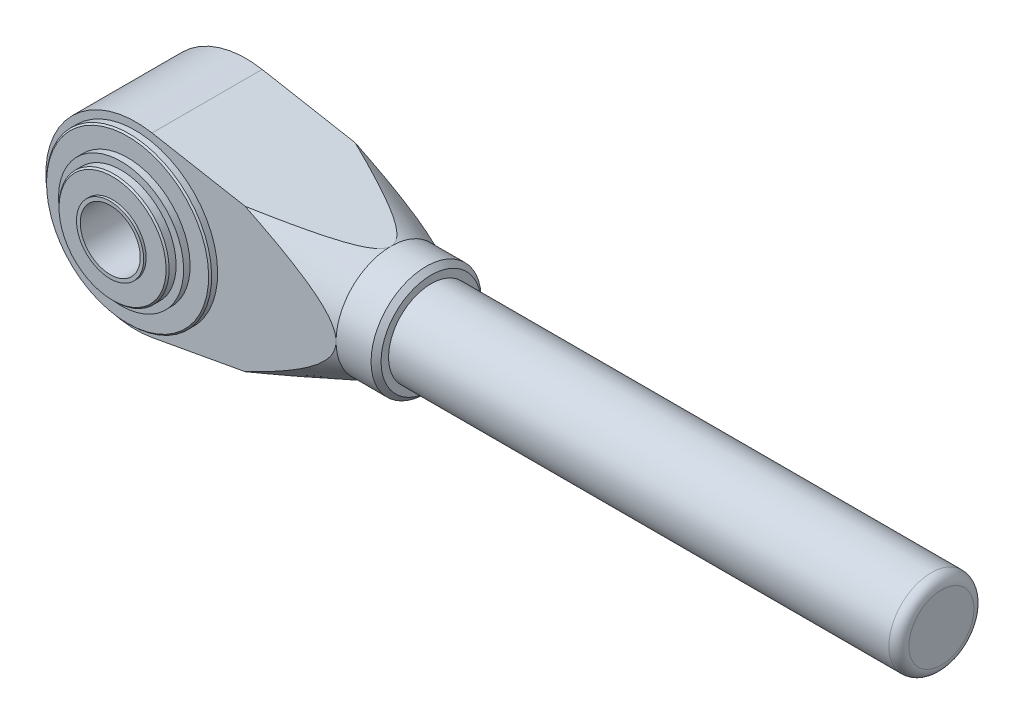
ISO-10303-21;
HEADER;
FILE_DESCRIPTION(('STEP AP214'),'2;1');
FILE_NAME('part.step','',(''),(''),'','','');
FILE_SCHEMA(('AUTOMOTIVE_DESIGN { 1 0 10303 214 1 1 1 1 }'));
ENDSEC;
DATA;
#1=APPLICATION_CONTEXT('core data for automotive mechanical design processes');
#2=APPLICATION_PROTOCOL_DEFINITION('international standard','automotive_design',2000,#1);
#3=PRODUCT_CONTEXT('',#1,'mechanical');
#4=PRODUCT('Part','Part','',(#3));
#5=PRODUCT_RELATED_PRODUCT_CATEGORY('part','',(#4));
#6=PRODUCT_DEFINITION_FORMATION('','',#4);
#7=PRODUCT_DEFINITION_CONTEXT('part definition',#1,'design');
#8=PRODUCT_DEFINITION('design','',#6,#7);
#9=PRODUCT_DEFINITION_SHAPE('','',#8);
#10=(LENGTH_UNIT() NAMED_UNIT(*) SI_UNIT(.MILLI.,.METRE.));
#11=(NAMED_UNIT(*) PLANE_ANGLE_UNIT() SI_UNIT($,.RADIAN.));
#12=(NAMED_UNIT(*) SI_UNIT($,.STERADIAN.) SOLID_ANGLE_UNIT());
#13=UNCERTAINTY_MEASURE_WITH_UNIT(LENGTH_MEASURE(1.E-05),#10,'distance_accuracy_value','');
#14=(GEOMETRIC_REPRESENTATION_CONTEXT(3) GLOBAL_UNCERTAINTY_ASSIGNED_CONTEXT((#13)) GLOBAL_UNIT_ASSIGNED_CONTEXT((#10,
#11,#12)) REPRESENTATION_CONTEXT('',''));
#15=CARTESIAN_POINT('',(0.,0.,0.));
#16=DIRECTION('',(0.,0.,1.));
#17=DIRECTION('',(1.,0.,0.));
#18=AXIS2_PLACEMENT_3D('',#15,#16,#17);
#19=CARTESIAN_POINT('',(-10.7417343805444,4.9960036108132E-13,0.));
#20=DIRECTION('',(0.,0.,-1.));
#21=DIRECTION('',(0.,1.,0.));
#22=AXIS2_PLACEMENT_3D('',#19,#20,#21);
#23=PLANE('',#22);
#24=CARTESIAN_POINT('',(-0.0417343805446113,4.9960036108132E-13,0.));
#25=DIRECTION('',(0.,0.,1.));
#26=DIRECTION('',(0.,-1.,0.));
#27=AXIS2_PLACEMENT_3D('',#24,#25,#26);
#28=CIRCLE('',#27,10.6999999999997);
#29=CARTESIAN_POINT('',(-0.0417343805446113,-10.6999999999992,0.));
#30=VERTEX_POINT('',#29);
#31=EDGE_CURVE('E99',#30,#30,#28,.T.);
#32=ORIENTED_EDGE('',*,*,#31,.F.);
#33=EDGE_LOOP('',(#32));
#34=FACE_BOUND('',#33,.T.);
#35=CARTESIAN_POINT('',(0.,0.,0.));
#36=DIRECTION('',(0.,0.,-1.));
#37=DIRECTION('',(-1.,0.,0.));
#38=AXIS2_PLACEMENT_3D('',#35,#36,#37);
#39=CIRCLE('',#38,6.);
#40=CARTESIAN_POINT('',(-6.,0.,0.));
#41=VERTEX_POINT('',#40);
#42=EDGE_CURVE('E377',#41,#41,#39,.T.);
#43=ORIENTED_EDGE('',*,*,#42,.F.);
#44=EDGE_LOOP('',(#43));
#45=FACE_BOUND('',#44,.T.);
#46=ADVANCED_FACE('F15',(#34,#45),#23,.T.);
#47=CARTESIAN_POINT('',(-0.0417343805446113,0.,31.5000000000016));
#48=DIRECTION('',(0.,0.,1.));
#49=DIRECTION('',(0.,-1.,0.));
#50=AXIS2_PLACEMENT_3D('',#47,#48,#49);
#51=PLANE('',#50);
#52=CARTESIAN_POINT('',(-0.0417343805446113,0.,31.5000000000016));
#53=DIRECTION('',(0.,0.,1.));
#54=DIRECTION('',(0.,-1.,0.));
#55=AXIS2_PLACEMENT_3D('',#52,#53,#54);
#56=CIRCLE('',#55,6.712);
#57=CARTESIAN_POINT('',(-0.0417343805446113,-6.712,31.5000000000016));
#58=VERTEX_POINT('',#57);
#59=EDGE_CURVE('E155',#58,#58,#56,.T.);
#60=ORIENTED_EDGE('',*,*,#59,.T.);
#61=EDGE_LOOP('',(#60));
#62=FACE_BOUND('',#61,.T.);
#63=CARTESIAN_POINT('',(0.,0.,31.5000000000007));
#64=DIRECTION('',(0.,0.,-1.));
#65=DIRECTION('',(-1.,0.,0.));
#66=AXIS2_PLACEMENT_3D('',#63,#64,#65);
#67=CIRCLE('',#66,6.);
#68=CARTESIAN_POINT('',(-6.,0.,31.5000000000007));
#69=VERTEX_POINT('',#68);
#70=EDGE_CURVE('E374',#69,#69,#67,.T.);
#71=ORIENTED_EDGE('',*,*,#70,.T.);
#72=EDGE_LOOP('',(#71));
#73=FACE_BOUND('',#72,.T.);
#74=ADVANCED_FACE('F194',(#62,#73),#51,.T.);
#75=CARTESIAN_POINT('',(0.121901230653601,0.,26.5000000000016));
#76=DIRECTION('',(0.,0.,1.));
#77=DIRECTION('',(1.,0.,0.));
#78=AXIS2_PLACEMENT_3D('',#75,#76,#77);
#79=PLANE('',#78);
#80=CARTESIAN_POINT('',(-3.72532117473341,-25.7778422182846,26.5000000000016));
#81=CARTESIAN_POINT('',(-2.68622910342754,-25.3391163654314,26.5000000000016));
#82=CARTESIAN_POINT('',(-1.64773620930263,-24.8989658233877,26.5000000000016));
#83=CARTESIAN_POINT('',(0.427802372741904,-24.0152397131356,26.5000000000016));
#84=CARTESIAN_POINT('',(1.46484804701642,-23.5716641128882,26.5000000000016));
#85=CARTESIAN_POINT('',(3.53760665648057,-22.680355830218,26.5000000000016));
#86=CARTESIAN_POINT('',(4.57331895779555,-22.2326216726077,26.5000000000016));
#87=CARTESIAN_POINT('',(6.64267440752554,-21.3324030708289,26.5000000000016));
#88=CARTESIAN_POINT('',(7.67631756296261,-20.879918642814,26.5000000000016));
#89=CARTESIAN_POINT('',(9.74060868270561,-19.9694532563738,26.5000000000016));
#90=CARTESIAN_POINT('',(10.7712578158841,-19.5114749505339,26.5000000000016));
#91=CARTESIAN_POINT('',(12.8294413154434,-18.5885728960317,26.5000000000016));
#92=CARTESIAN_POINT('',(13.8569756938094,-18.1236491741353,26.5000000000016));
#93=CARTESIAN_POINT('',(15.9079172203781,-17.1852862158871,26.5000000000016));
#94=CARTESIAN_POINT('',(16.9313251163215,-16.7118486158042,26.5000000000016));
#95=CARTESIAN_POINT('',(18.9730536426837,-15.7541338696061,26.5000000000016));
#96=CARTESIAN_POINT('',(19.9913743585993,-15.2698569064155,26.5000000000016));
#97=CARTESIAN_POINT('',(21.5135119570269,-14.5330073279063,26.5000000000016));
#98=CARTESIAN_POINT('',(22.0198836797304,-14.2857103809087,26.5000000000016));
#99=CARTESIAN_POINT('',(23.0306235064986,-13.7870582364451,26.5000000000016));
#100=CARTESIAN_POINT('',(23.5349916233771,-13.5357030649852,26.5000000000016));
#101=CARTESIAN_POINT('',(24.5414975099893,-13.0282209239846,26.5000000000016));
#102=CARTESIAN_POINT('',(25.043634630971,-12.7720926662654,26.5000000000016));
#103=CARTESIAN_POINT('',(26.0450611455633,-12.2543275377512,26.5000000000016));
#104=CARTESIAN_POINT('',(26.544350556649,-11.9926907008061,26.5000000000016));
#105=CARTESIAN_POINT('',(27.541132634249,-11.4620061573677,26.5000000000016));
#106=CARTESIAN_POINT('',(28.0386136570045,-11.1929365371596,26.5000000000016));
#107=CARTESIAN_POINT('',(29.0292336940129,-10.6469251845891,26.5000000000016));
#108=CARTESIAN_POINT('',(29.5223727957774,-10.369983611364,26.5000000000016));
#109=CARTESIAN_POINT('',(30.5029112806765,-9.80665053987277,26.5000000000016));
#110=CARTESIAN_POINT('',(30.9903134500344,-9.52026390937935,26.5000000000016));
#111=CARTESIAN_POINT('',(31.9579210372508,-8.93563735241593,26.5000000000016));
#112=CARTESIAN_POINT('',(32.4381270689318,-8.63739844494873,26.5000000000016));
#113=CARTESIAN_POINT('',(33.3923126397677,-8.02374443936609,26.5000000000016));
#114=CARTESIAN_POINT('',(33.8662246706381,-7.70822332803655,26.5000000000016));
#115=CARTESIAN_POINT('',(34.5669554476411,-7.21991933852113,26.5000000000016));
#116=CARTESIAN_POINT('',(34.7989526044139,-7.0545639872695,26.5000000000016));
#117=CARTESIAN_POINT('',(35.2587372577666,-6.71809405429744,26.5000000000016));
#118=CARTESIAN_POINT('',(35.4865248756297,-6.5469796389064,26.5000000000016));
#119=CARTESIAN_POINT('',(35.9359444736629,-6.19883276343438,26.5000000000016));
#120=CARTESIAN_POINT('',(36.157599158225,-6.02182970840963,26.5000000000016));
#121=CARTESIAN_POINT('',(36.5945468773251,-5.66003599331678,26.5000000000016));
#122=CARTESIAN_POINT('',(36.8098389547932,-5.47524417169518,26.5000000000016));
#123=CARTESIAN_POINT('',(37.2319288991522,-5.0968184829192,26.5000000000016));
#124=CARTESIAN_POINT('',(37.4387397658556,-4.9031991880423,26.5000000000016));
#125=CARTESIAN_POINT('',(37.8417140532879,-4.50524105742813,26.5000000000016));
#126=CARTESIAN_POINT('',(38.0378820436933,-4.3009068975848,26.5000000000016));
#127=CARTESIAN_POINT('',(38.3643621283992,-3.93713439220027,26.5000000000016));
#128=CARTESIAN_POINT('',(38.4980124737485,-3.78070093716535,26.5000000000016));
#129=CARTESIAN_POINT('',(38.7560212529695,-3.46023958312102,26.5000000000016));
#130=CARTESIAN_POINT('',(38.880377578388,-3.29620997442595,26.5000000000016));
#131=CARTESIAN_POINT('',(39.1170768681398,-2.96015632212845,26.5000000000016));
#132=CARTESIAN_POINT('',(39.2294460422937,-2.7881509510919,26.5000000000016));
#133=CARTESIAN_POINT('',(39.4393056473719,-2.43539919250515,26.5000000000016));
#134=CARTESIAN_POINT('',(39.5368047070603,-2.2546579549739,26.5000000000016));
#135=CARTESIAN_POINT('',(39.739577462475,-1.82864470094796,26.5000000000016));
#136=CARTESIAN_POINT('',(39.8384934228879,-1.58020702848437,26.5000000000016));
#137=CARTESIAN_POINT('',(39.9561702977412,-1.19833485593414,26.5000000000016));
#138=CARTESIAN_POINT('',(39.9902753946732,-1.06953910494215,26.5000000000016));
#139=CARTESIAN_POINT('',(40.0472534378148,-0.809507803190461,26.5000000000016));
#140=CARTESIAN_POINT('',(40.0701317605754,-0.678273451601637,26.5000000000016));
#141=CARTESIAN_POINT('',(40.103991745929,-0.413180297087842,26.5000000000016));
#142=CARTESIAN_POINT('',(40.1148749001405,-0.279308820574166,26.5000000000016));
#143=CARTESIAN_POINT('',(40.1239905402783,-0.0111354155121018,26.5000000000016));
#144=CARTESIAN_POINT('',(40.1222234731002,0.123166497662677,26.5000000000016));
#145=CARTESIAN_POINT('',(40.1061041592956,0.391070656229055,26.5000000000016));
#146=CARTESIAN_POINT('',(40.0917459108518,0.524672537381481,26.5000000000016));
#147=CARTESIAN_POINT('',(40.0509790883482,0.790072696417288,26.5000000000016));
#148=CARTESIAN_POINT('',(40.0245641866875,0.921869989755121,26.5000000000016));
#149=CARTESIAN_POINT('',(39.9553361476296,1.20415910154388,26.5000000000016));
#150=CARTESIAN_POINT('',(39.9105418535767,1.35416468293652,26.5000000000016));
#151=CARTESIAN_POINT('',(39.8076378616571,1.64957906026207,26.5000000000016));
#152=CARTESIAN_POINT('',(39.7495184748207,1.79498442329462,26.5000000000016));
#153=CARTESIAN_POINT('',(39.557949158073,2.22376367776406,26.5000000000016));
#154=CARTESIAN_POINT('',(39.4073376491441,2.49951560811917,26.5000000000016));
#155=CARTESIAN_POINT('',(39.0899156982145,3.00522394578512,26.5000000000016));
#156=CARTESIAN_POINT('',(38.9259644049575,3.2370478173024,26.5000000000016));
#157=CARTESIAN_POINT('',(38.5788664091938,3.68606115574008,26.5000000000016));
#158=CARTESIAN_POINT('',(38.3957019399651,3.9032367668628,26.5000000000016));
#159=CARTESIAN_POINT('',(38.0146958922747,4.32559202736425,26.5000000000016));
#160=CARTESIAN_POINT('',(37.8168034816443,4.53072530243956,26.5000000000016));
#161=CARTESIAN_POINT('',(37.5120908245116,4.83022761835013,26.5000000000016));
#162=CARTESIAN_POINT('',(37.409228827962,4.92867670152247,26.5000000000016));
#163=CARTESIAN_POINT('',(37.2011768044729,5.12308412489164,26.5000000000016));
#164=CARTESIAN_POINT('',(37.095986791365,5.21904247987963,26.5000000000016));
#165=CARTESIAN_POINT('',(36.7833353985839,5.49815935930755,26.5000000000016));
#166=CARTESIAN_POINT('',(36.573041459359,5.67814923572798,26.5000000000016));
#167=CARTESIAN_POINT('',(36.1463718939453,6.03079499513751,26.5000000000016));
#168=CARTESIAN_POINT('',(35.9299952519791,6.20344964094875,26.5000000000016));
#169=CARTESIAN_POINT('',(35.4922378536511,6.54254574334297,26.5000000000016));
#170=CARTESIAN_POINT('',(35.2708542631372,6.70898353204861,26.5000000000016));
#171=CARTESIAN_POINT('',(34.8240787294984,7.03640009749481,26.5000000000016));
#172=CARTESIAN_POINT('',(34.5986865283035,7.19737852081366,26.5000000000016));
#173=CARTESIAN_POINT('',(33.9165627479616,7.67390898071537,26.5000000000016));
#174=CARTESIAN_POINT('',(33.4548433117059,7.98232468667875,26.5000000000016));
#175=CARTESIAN_POINT('',(32.5219519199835,8.58451221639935,26.5000000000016));
#176=CARTESIAN_POINT('',(32.0507787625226,8.87828216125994,26.5000000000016));
#177=CARTESIAN_POINT('',(31.3365905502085,9.31149186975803,26.5000000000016));
#178=CARTESIAN_POINT('',(31.0961981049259,9.45528012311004,26.5000000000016));
#179=CARTESIAN_POINT('',(30.6138541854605,9.74017626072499,26.5000000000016));
#180=CARTESIAN_POINT('',(30.3719028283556,9.8812843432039,26.5000000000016));
#181=CARTESIAN_POINT('',(29.6439329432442,10.3010445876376,26.5000000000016));
#182=CARTESIAN_POINT('',(29.1558425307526,10.5761062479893,26.5000000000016));
#183=CARTESIAN_POINT('',(28.1761202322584,11.1179334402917,26.5000000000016));
#184=CARTESIAN_POINT('',(27.684495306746,11.3847116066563,26.5000000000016));
#185=CARTESIAN_POINT('',(26.697775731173,11.9117219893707,26.5000000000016));
#186=CARTESIAN_POINT('',(26.2026811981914,12.171954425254,26.5000000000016));
#187=CARTESIAN_POINT('',(25.2006817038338,12.6915420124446,26.5000000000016));
#188=CARTESIAN_POINT('',(24.6937247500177,12.9507967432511,26.5000000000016));
#189=CARTESIAN_POINT('',(23.6773443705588,13.4644294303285,26.5000000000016));
#190=CARTESIAN_POINT('',(23.1679209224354,13.718807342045,26.5000000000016));
#191=CARTESIAN_POINT('',(21.6365155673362,14.4757008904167,26.5000000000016));
#192=CARTESIAN_POINT('',(20.6114385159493,14.9719558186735,26.5000000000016));
#193=CARTESIAN_POINT('',(18.5551044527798,15.9519085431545,26.5000000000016));
#194=CARTESIAN_POINT('',(17.5238463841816,16.4356041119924,26.5000000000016));
#195=CARTESIAN_POINT('',(15.4567458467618,17.3931121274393,26.5000000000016));
#196=CARTESIAN_POINT('',(14.4209033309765,17.8669244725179,26.5000000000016));
#197=CARTESIAN_POINT('',(12.3441559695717,18.8073378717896,26.5000000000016));
#198=CARTESIAN_POINT('',(11.3032459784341,19.2739275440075,26.5000000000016));
#199=CARTESIAN_POINT('',(9.21856591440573,20.2006797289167,26.5000000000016));
#200=CARTESIAN_POINT('',(8.17479582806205,20.6608422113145,26.5000000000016));
#201=CARTESIAN_POINT('',(6.08504972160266,21.5758145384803,26.5000000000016));
#202=CARTESIAN_POINT('',(5.03907395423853,22.0306249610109,26.5000000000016));
#203=CARTESIAN_POINT('',(2.9452045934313,22.9358096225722,26.5000000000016));
#204=CARTESIAN_POINT('',(1.89731099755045,23.3861838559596,26.5000000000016));
#205=CARTESIAN_POINT('',(-1.09946146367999,24.6678556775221,26.5000000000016));
#206=CARTESIAN_POINT('',(-3.050295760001,25.4945810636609,26.5000000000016));
#207=CARTESIAN_POINT('',(-6.95607716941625,27.1384203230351,26.5000000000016));
#208=CARTESIAN_POINT('',(-8.911024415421,27.9555338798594,26.5000000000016));
#209=CARTESIAN_POINT('',(-12.8195080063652,29.5804342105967,26.5000000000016));
#210=CARTESIAN_POINT('',(-14.7730372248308,30.3882381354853,26.5000000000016));
#211=CARTESIAN_POINT('',(-17.705097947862,31.5955301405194,26.5000000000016));
#212=CARTESIAN_POINT('',(-18.6827253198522,31.9972167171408,26.5000000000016));
#213=CARTESIAN_POINT('',(-20.6385204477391,32.7992701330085,26.5000000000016));
#214=CARTESIAN_POINT('',(-21.6166882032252,33.1996369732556,26.5000000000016));
#215=CARTESIAN_POINT('',(-22.5950957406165,33.5994171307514,26.5000000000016));
#216=B_SPLINE_CURVE_WITH_KNOTS('',3,(#80,#81,#82,#83,#84,#85,#86,#87,#88,#89,#90,#91,#92,#93,
#94,#95,#96,#97,#98,#99,#100,#101,#102,#103,#104,#105,#106,#107,#108,#109,#110,#111,#112,#113,
#114,#115,#116,#117,#118,#119,#120,#121,#122,#123,#124,#125,#126,#127,#128,#129,#130,#131,#132,
#133,#134,#135,#136,#137,#138,#139,#140,#141,#142,#143,#144,#145,#146,#147,#148,#149,#150,#151,
#152,#153,#154,#155,#156,#157,#158,#159,#160,#161,#162,#163,#164,#165,#166,#167,#168,#169,#170,
#171,#172,#173,#174,#175,#176,#177,#178,#179,#180,#181,#182,#183,#184,#185,#186,#187,#188,#189,
#190,#191,#192,#193,#194,#195,#196,#197,#198,#199,#200,#201,#202,#203,#204,#205,#206,#207,#208,
#209,#210,#211,#212,#213,#214,#215),.UNSPECIFIED.,.F.,.F.,(4,2,2,2,2,2,2,2,2,2,2,2,2,2,2,2,2,2,
2,2,2,2,2,2,2,2,2,2,2,2,2,2,2,2,2,2,2,2,2,2,2,2,2,2,2,2,2,2,2,2,2,2,2,2,2,2,2,2,2,2,2,2,2,2,2,2,
2,4),(0.,3.38374778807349,6.76752726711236,10.1525567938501,13.5375748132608,16.9210194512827,
20.3044510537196,23.6872392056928,27.069970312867,28.7605513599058,30.4511215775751,
32.1421548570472,33.8331777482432,35.5298725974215,37.2265331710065,38.9223325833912,
40.6179865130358,42.3255613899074,43.1801760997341,44.0347661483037,44.8855899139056,
45.7365410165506,46.5861349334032,47.435361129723,48.0523336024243,48.6694456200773,
49.2851794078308,49.9005545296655,50.6995102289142,51.0988030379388,51.4979044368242,
51.9002595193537,52.3026003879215,52.7051331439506,53.1078774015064,53.5767916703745,
54.04604798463,54.9851283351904,55.8358160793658,56.6872975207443,57.5418677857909,
57.9689831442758,58.3960959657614,59.226283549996,60.0566106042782,60.8874200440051,
61.7182831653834,63.3836254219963,65.0491807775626,65.8895064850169,66.7297698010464,
68.4104503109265,70.088427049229,71.7663474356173,73.4745217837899,75.1827117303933,
78.5992261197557,82.0163423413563,85.4334936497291,88.8555717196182,92.277665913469,
95.6993872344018,99.1211129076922,105.477413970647,111.833923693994,118.175788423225,
121.346586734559,124.517382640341),.UNSPECIFIED.);
#217=CARTESIAN_POINT('',(21.9632818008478,14.312615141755,26.5000000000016));
#218=VERTEX_POINT('',#217);
#219=CARTESIAN_POINT('',(40.1219012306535,0.,26.5000000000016));
#220=VERTEX_POINT('',#219);
#221=EDGE_CURVE('E91',#218,#220,#216,.F.);
#222=ORIENTED_EDGE('',*,*,#221,.F.);
#223=DIRECTION('',(-0.983764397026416,0.179464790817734,0.));
#224=VECTOR('',#223,1.);
#225=CARTESIAN_POINT('',(40.1219012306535,11.,26.5000000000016));
#226=LINE('',#225,#224);
#227=CARTESIAN_POINT('',(3.35226561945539,17.70775948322,26.5000000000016));
#228=VERTEX_POINT('',#227);
#229=EDGE_CURVE('E163',#218,#228,#226,.T.);
#230=ORIENTED_EDGE('',*,*,#229,.T.);
#231=CARTESIAN_POINT('',(0.121901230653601,0.,26.5000000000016));
#232=DIRECTION('',(0.,0.,1.));
#233=DIRECTION('',(1.,0.,0.));
#234=AXIS2_PLACEMENT_3D('',#231,#232,#233);
#235=CIRCLE('',#234,18.);
#236=CARTESIAN_POINT('',(3.3522693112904,-17.7077588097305,26.5000000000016));
#237=VERTEX_POINT('',#236);
#238=EDGE_CURVE('E153',#228,#237,#235,.T.);
#239=ORIENTED_EDGE('',*,*,#238,.T.);
#240=DIRECTION('',(-0.983764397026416,-0.179464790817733,0.));
#241=VECTOR('',#240,1.);
#242=CARTESIAN_POINT('',(40.1219012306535,-11.,26.5000000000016));
#243=LINE('',#242,#241);
#244=CARTESIAN_POINT('',(21.963281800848,-14.3126151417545,26.5000000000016));
#245=VERTEX_POINT('',#244);
#246=EDGE_CURVE('E105',#245,#237,#243,.T.);
#247=ORIENTED_EDGE('',*,*,#246,.F.);
#248=EDGE_CURVE('E79',#220,#245,#216,.F.);
#249=ORIENTED_EDGE('',*,*,#248,.F.);
#250=EDGE_LOOP('',(#222,#230,#239,#247,#249));
#251=FACE_BOUND('',#250,.T.);
#252=CARTESIAN_POINT('',(-0.0417343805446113,0.,26.5000000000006));
#253=DIRECTION('',(0.,0.,1.));
#254=DIRECTION('',(0.,-1.,0.));
#255=AXIS2_PLACEMENT_3D('',#252,#253,#254);
#256=CIRCLE('',#255,16.5);
#257=CARTESIAN_POINT('',(-0.0417343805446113,-16.5,26.5000000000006));
#258=VERTEX_POINT('',#257);
#259=EDGE_CURVE('E315',#258,#258,#256,.T.);
#260=ORIENTED_EDGE('',*,*,#259,.F.);
#261=EDGE_LOOP('',(#260));
#262=FACE_BOUND('',#261,.T.);
#263=ADVANCED_FACE('F102',(#251,#262),#79,.T.);
#264=CARTESIAN_POINT('',(0.121901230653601,0.,26.5000000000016));
#265=DIRECTION('',(0.,0.,-1.));
#266=DIRECTION('',(-1.,0.,0.));
#267=AXIS2_PLACEMENT_3D('',#264,#265,#266);
#268=CYLINDRICAL_SURFACE('',#267,18.);
#269=CARTESIAN_POINT('',(0.121901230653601,0.,4.5000000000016));
#270=DIRECTION('',(0.,0.,1.));
#271=DIRECTION('',(1.,0.,0.));
#272=AXIS2_PLACEMENT_3D('',#269,#270,#271);
#273=CIRCLE('',#272,18.);
#274=CARTESIAN_POINT('',(3.35226561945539,17.70775948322,4.5000000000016));
#275=VERTEX_POINT('',#274);
#276=CARTESIAN_POINT('',(3.3522693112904,-17.7077588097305,4.5000000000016));
#277=VERTEX_POINT('',#276);
#278=EDGE_CURVE('E149',#275,#277,#273,.T.);
#279=ORIENTED_EDGE('',*,*,#278,.T.);
#280=DIRECTION('',(0.,0.,-1.));
#281=VECTOR('',#280,1.);
#282=CARTESIAN_POINT('',(3.3522693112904,-17.7077588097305,26.5000000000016));
#283=LINE('',#282,#281);
#284=EDGE_CURVE('E86',#237,#277,#283,.T.);
#285=ORIENTED_EDGE('',*,*,#284,.F.);
#286=ORIENTED_EDGE('',*,*,#238,.F.);
#287=DIRECTION('',(0.,0.,-1.));
#288=VECTOR('',#287,1.);
#289=CARTESIAN_POINT('',(3.35226561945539,17.70775948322,26.5000000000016));
#290=LINE('',#289,#288);
#291=EDGE_CURVE('E165',#228,#275,#290,.T.);
#292=ORIENTED_EDGE('',*,*,#291,.T.);
#293=EDGE_LOOP('',(#279,#285,#286,#292));
#294=FACE_BOUND('',#293,.T.);
#295=ADVANCED_FACE('F270',(#294),#268,.T.);
#296=CARTESIAN_POINT('',(40.1219012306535,-11.,26.5000000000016));
#297=DIRECTION('',(0.179464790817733,-0.983764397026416,0.));
#298=DIRECTION('',(0.983764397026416,0.179464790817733,0.));
#299=AXIS2_PLACEMENT_3D('',#296,#297,#298);
#300=PLANE('',#299);
#301=CARTESIAN_POINT('',(21.9627816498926,-14.312706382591,26.5002000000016));
#302=CARTESIAN_POINT('',(22.4567435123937,-14.2225946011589,26.3026524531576));
#303=CARTESIAN_POINT('',(22.950250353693,-14.1325658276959,26.1039203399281));
#304=CARTESIAN_POINT('',(23.9361520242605,-13.9527111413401,25.7035763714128));
#305=CARTESIAN_POINT('',(24.4285468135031,-13.862885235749,25.501964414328));
#306=CARTESIAN_POINT('',(25.4128124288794,-13.6833290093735,25.0950229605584));
#307=CARTESIAN_POINT('',(25.9046809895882,-13.5935991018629,24.8896877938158));
#308=CARTESIAN_POINT('',(26.8867485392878,-13.414443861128,24.4749490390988));
#309=CARTESIAN_POINT('',(27.3769475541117,-13.325018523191,24.2655455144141));
#310=CARTESIAN_POINT('',(28.3782137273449,-13.1423609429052,23.8318485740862));
#311=CARTESIAN_POINT('',(28.8891814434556,-13.0491468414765,23.6073174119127));
#312=CARTESIAN_POINT('',(29.9081740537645,-12.8632554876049,23.1514633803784));
#313=CARTESIAN_POINT('',(30.4161989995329,-12.7705782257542,22.9201406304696));
#314=CARTESIAN_POINT('',(31.4278834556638,-12.5860200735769,22.4489920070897));
#315=CARTESIAN_POINT('',(31.9315464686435,-12.4941385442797,22.2091739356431));
#316=CARTESIAN_POINT('',(32.9334079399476,-12.3113723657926,21.7180841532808));
#317=CARTESIAN_POINT('',(33.4316069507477,-12.2204876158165,21.4668136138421));
#318=CARTESIAN_POINT('',(34.3350689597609,-12.0556721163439,20.9930752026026));
#319=CARTESIAN_POINT('',(34.7415789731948,-11.9815138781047,20.7730863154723));
#320=CARTESIAN_POINT('',(35.3455641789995,-11.8713309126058,20.4319418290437));
#321=CARTESIAN_POINT('',(35.5460485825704,-11.8347572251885,20.3162936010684));
#322=CARTESIAN_POINT('',(35.9445028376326,-11.7620685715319,20.080613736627));
#323=CARTESIAN_POINT('',(36.142472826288,-11.7259535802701,19.9605823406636));
#324=CARTESIAN_POINT('',(36.5333221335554,-11.6546522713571,19.7164666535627));
#325=CARTESIAN_POINT('',(36.7262323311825,-11.6194603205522,19.5924336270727));
#326=CARTESIAN_POINT('',(37.1080095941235,-11.54981399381,19.338120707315));
#327=CARTESIAN_POINT('',(37.2968772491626,-11.5153595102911,19.2078417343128));
#328=CARTESIAN_POINT('',(37.6689254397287,-11.4474880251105,18.9397763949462));
#329=CARTESIAN_POINT('',(37.8521151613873,-11.4140693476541,18.8020032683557));
#330=CARTESIAN_POINT('',(38.2110391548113,-11.348592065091,18.5168190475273));
#331=CARTESIAN_POINT('',(38.3867775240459,-11.3165327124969,18.3694133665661));
#332=CARTESIAN_POINT('',(38.6440130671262,-11.2696061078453,18.137456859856));
#333=CARTESIAN_POINT('',(38.7295069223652,-11.2540097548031,18.0574853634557));
#334=CARTESIAN_POINT('',(38.8970303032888,-11.2234490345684,17.8938279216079));
#335=CARTESIAN_POINT('',(38.9790592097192,-11.2084847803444,17.8101413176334));
#336=CARTESIAN_POINT('',(39.1387742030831,-11.1793485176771,17.6385518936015));
#337=CARTESIAN_POINT('',(39.2164601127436,-11.165176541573,17.550648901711));
#338=CARTESIAN_POINT('',(39.3662734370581,-11.1378466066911,17.3701061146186));
#339=CARTESIAN_POINT('',(39.4384023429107,-11.1246883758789,17.2774676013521));
#340=CARTESIAN_POINT('',(39.6087739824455,-11.0936080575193,17.0407952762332));
#341=CARTESIAN_POINT('',(39.7028084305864,-11.0764536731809,16.8935441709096));
#342=CARTESIAN_POINT('',(39.8680599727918,-11.0463073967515,16.5862767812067));
#343=CARTESIAN_POINT('',(39.9393266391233,-11.0333064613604,16.4262891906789));
#344=CARTESIAN_POINT('',(40.0360896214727,-11.0156543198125,16.1362531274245));
#345=CARTESIAN_POINT('',(40.0685608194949,-11.0097307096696,16.0086531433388));
#346=CARTESIAN_POINT('',(40.1118044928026,-11.001841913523,15.7497451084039));
#347=CARTESIAN_POINT('',(40.122606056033,-10.9998714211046,15.6184422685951));
#348=CARTESIAN_POINT('',(40.121122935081,-11.0001419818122,15.3557577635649));
#349=CARTESIAN_POINT('',(40.1088000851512,-11.0023899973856,15.2243763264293));
#350=CARTESIAN_POINT('',(40.0626366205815,-11.010811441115,14.9655637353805));
#351=CARTESIAN_POINT('',(40.0287689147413,-11.0169898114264,14.8381377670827));
#352=CARTESIAN_POINT('',(39.9261156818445,-11.035716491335,14.5402486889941));
#353=CARTESIAN_POINT('',(39.8487931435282,-11.0498221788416,14.3728747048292));
#354=CARTESIAN_POINT('',(39.6699407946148,-11.0824496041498,14.052173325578));
#355=CARTESIAN_POINT('',(39.5683469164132,-11.1009830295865,13.8988846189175));
#356=CARTESIAN_POINT('',(39.323685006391,-11.1456158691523,13.5709759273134));
#357=CARTESIAN_POINT('',(39.1764590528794,-11.1724737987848,13.3996212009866));
#358=CARTESIAN_POINT('',(38.8664984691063,-11.2290188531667,13.071884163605));
#359=CARTESIAN_POINT('',(38.7037341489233,-11.2587113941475,12.9155317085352));
#360=CARTESIAN_POINT('',(38.3669776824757,-11.3201447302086,12.6137201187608));
#361=CARTESIAN_POINT('',(38.1929210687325,-11.3518972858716,12.4683360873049));
#362=CARTESIAN_POINT('',(37.9265728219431,-11.400486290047,12.2574127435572));
#363=CARTESIAN_POINT('',(37.8369539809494,-11.4168351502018,12.1883262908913));
#364=CARTESIAN_POINT('',(37.6561845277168,-11.4498123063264,12.0522579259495));
#365=CARTESIAN_POINT('',(37.565033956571,-11.4664405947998,11.9852759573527));
#366=CARTESIAN_POINT('',(37.2751275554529,-11.5193272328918,11.7767039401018));
#367=CARTESIAN_POINT('',(37.0739887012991,-11.5560203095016,11.6385336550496));
#368=CARTESIAN_POINT('',(36.6672455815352,-11.6302210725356,11.3691326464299));
#369=CARTESIAN_POINT('',(36.4616404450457,-11.6677289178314,11.2379032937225));
#370=CARTESIAN_POINT('',(36.0469100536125,-11.7433867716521,10.9810345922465));
#371=CARTESIAN_POINT('',(35.8377826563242,-11.7815371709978,10.8553988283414));
#372=CARTESIAN_POINT('',(35.4168560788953,-11.8583253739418,10.6088299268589));
#373=CARTESIAN_POINT('',(35.2050567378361,-11.8969632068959,10.4878970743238));
#374=CARTESIAN_POINT('',(34.5654004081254,-12.0136535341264,10.1303835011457));
#375=CARTESIAN_POINT('',(34.1343388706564,-12.0922906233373,9.89972841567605));
#376=CARTESIAN_POINT('',(33.26666040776,-12.2505782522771,9.45000371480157));
#377=CARTESIAN_POINT('',(32.8300455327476,-12.3302284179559,9.23092996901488));
#378=CARTESIAN_POINT('',(31.9523499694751,-12.4903434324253,8.80137445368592));
#379=CARTESIAN_POINT('',(31.511266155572,-12.5708088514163,8.59089930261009));
#380=CARTESIAN_POINT('',(30.6259668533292,-12.7323109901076,8.176790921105));
#381=CARTESIAN_POINT('',(30.1817511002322,-12.8133477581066,7.9731582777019));
#382=CARTESIAN_POINT('',(29.2915319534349,-12.9757474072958,7.57166563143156));
#383=CARTESIAN_POINT('',(28.8455318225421,-13.0571096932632,7.37379813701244));
#384=CARTESIAN_POINT('',(27.9516338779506,-13.2201804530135,6.9825412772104));
#385=CARTESIAN_POINT('',(27.5037360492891,-13.301888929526,6.78915194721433));
#386=CARTESIAN_POINT('',(26.6320082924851,-13.4609152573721,6.41702131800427));
#387=CARTESIAN_POINT('',(26.2082634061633,-13.5382175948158,6.23807386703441));
#388=CARTESIAN_POINT('',(25.3595137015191,-13.6930521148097,5.88293676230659));
#389=CARTESIAN_POINT('',(24.9345085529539,-13.770584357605,5.70674792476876));
#390=CARTESIAN_POINT('',(24.085446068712,-13.9254759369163,5.35756198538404));
#391=CARTESIAN_POINT('',(23.6613930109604,-14.002834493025,5.18455412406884));
#392=CARTESIAN_POINT('',(22.8126006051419,-14.1576768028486,4.84066957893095));
#393=CARTESIAN_POINT('',(22.3878615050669,-14.2351605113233,4.6697922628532));
#394=CARTESIAN_POINT('',(21.962781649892,-14.312706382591,4.4998000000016));
#395=B_SPLINE_CURVE_WITH_KNOTS('',3,(#301,#302,#303,#304,#305,#306,#307,#308,#309,#310,#311,
#312,#313,#314,#315,#316,#317,#318,#319,#320,#321,#322,#323,#324,#325,#326,#327,#328,#329,#330,
#331,#332,#333,#334,#335,#336,#337,#338,#339,#340,#341,#342,#343,#344,#345,#346,#347,#348,#349,
#350,#351,#352,#353,#354,#355,#356,#357,#358,#359,#360,#361,#362,#363,#364,#365,#366,#367,#368,
#369,#370,#371,#372,#373,#374,#375,#376,#377,#378,#379,#380,#381,#382,#383,#384,#385,#386,#387,
#388,#389,#390,#391,#392,#393,#394),.UNSPECIFIED.,.F.,.F.,(4,2,2,2,2,2,2,2,2,2,2,2,2,2,2,2,2,2,
2,2,2,2,2,2,2,2,2,2,2,2,2,2,2,2,2,2,2,2,2,2,2,2,2,2,2,2,4),(0.,1.61873478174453,
3.23752692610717,4.85903524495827,6.48051835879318,8.17804332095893,9.87553844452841,
11.5715130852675,13.267314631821,14.6714543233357,15.3743735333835,16.0772542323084,
16.7732446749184,17.4691328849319,18.1638292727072,18.8581385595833,19.2123545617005,
19.5666336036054,19.9209270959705,20.275125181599,20.8003552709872,21.3244338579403,
21.7181863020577,22.111409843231,22.5052829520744,22.8996523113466,23.4512041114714,
24.0042282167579,24.6851476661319,25.367395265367,26.0539553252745,26.3969296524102,
26.7398947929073,27.4799944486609,28.2202397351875,28.9609528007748,29.7017106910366,
31.1869682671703,32.6716925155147,34.1575388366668,35.6435123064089,37.1274598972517,
38.6114192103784,40.010699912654,41.4103870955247,42.8038065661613,44.1968021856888),.UNSPECIFIED.);
#396=CARTESIAN_POINT('',(40.1219012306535,-11.,15.5000000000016));
#397=VERTEX_POINT('',#396);
#398=EDGE_CURVE('E80',#245,#397,#395,.T.);
#399=ORIENTED_EDGE('',*,*,#398,.F.);
#400=ORIENTED_EDGE('',*,*,#246,.T.);
#401=ORIENTED_EDGE('',*,*,#284,.T.);
#402=DIRECTION('',(-0.983764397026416,-0.179464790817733,0.));
#403=VECTOR('',#402,1.);
#404=CARTESIAN_POINT('',(40.1219012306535,-11.,4.5000000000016));
#405=LINE('',#404,#403);
#406=CARTESIAN_POINT('',(21.9632818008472,-14.3126151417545,4.5000000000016));
#407=VERTEX_POINT('',#406);
#408=EDGE_CURVE('E142',#407,#277,#405,.T.);
#409=ORIENTED_EDGE('',*,*,#408,.F.);
#410=EDGE_CURVE('E37',#397,#407,#395,.T.);
#411=ORIENTED_EDGE('',*,*,#410,.F.);
#412=EDGE_LOOP('',(#399,#400,#401,#409,#411));
#413=FACE_BOUND('',#412,.T.);
#414=ADVANCED_FACE('F145',(#413),#300,.T.);
#415=CARTESIAN_POINT('',(40.1219012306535,11.,26.5000000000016));
#416=DIRECTION('',(-0.179464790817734,-0.983764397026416,0.));
#417=DIRECTION('',(0.983764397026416,-0.179464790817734,0.));
#418=AXIS2_PLACEMENT_3D('',#415,#416,#417);
#419=PLANE('',#418);
#420=ORIENTED_EDGE('',*,*,#229,.F.);
#421=CARTESIAN_POINT('',(21.9627816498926,14.3127063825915,26.5002000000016));
#422=CARTESIAN_POINT('',(22.4567435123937,14.2225946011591,26.3026524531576));
#423=CARTESIAN_POINT('',(22.950250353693,14.132565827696,26.103920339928));
#424=CARTESIAN_POINT('',(23.9361520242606,13.95271114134,25.7035763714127));
#425=CARTESIAN_POINT('',(24.4285468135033,13.862885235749,25.5019644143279));
#426=CARTESIAN_POINT('',(25.4128124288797,13.6833290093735,25.0950229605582));
#427=CARTESIAN_POINT('',(25.9046809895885,13.5935991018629,24.8896877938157));
#428=CARTESIAN_POINT('',(26.8867485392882,13.4144438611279,24.4749490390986));
#429=CARTESIAN_POINT('',(27.3769475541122,13.3250185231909,24.2655455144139));
#430=CARTESIAN_POINT('',(28.3782137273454,13.1423609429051,23.8318485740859));
#431=CARTESIAN_POINT('',(28.889181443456,13.0491468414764,23.6073174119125));
#432=CARTESIAN_POINT('',(29.9081740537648,12.8632554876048,23.1514633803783));
#433=CARTESIAN_POINT('',(30.4161989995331,12.7705782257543,22.9201406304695));
#434=CARTESIAN_POINT('',(31.4278834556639,12.5860200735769,22.4489920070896));
#435=CARTESIAN_POINT('',(31.9315464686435,12.4941385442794,22.2091739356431));
#436=CARTESIAN_POINT('',(32.9334079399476,12.3113723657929,21.7180841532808));
#437=CARTESIAN_POINT('',(33.4316069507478,12.2204876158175,21.466813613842));
#438=CARTESIAN_POINT('',(34.3350689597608,12.0556721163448,20.9930752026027));
#439=CARTESIAN_POINT('',(34.7415789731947,11.9815138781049,20.7730863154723));
#440=CARTESIAN_POINT('',(35.3455641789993,11.8713309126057,20.4319418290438));
#441=CARTESIAN_POINT('',(35.5460485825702,11.8347572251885,20.3162936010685));
#442=CARTESIAN_POINT('',(35.9445028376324,11.7620685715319,20.0806137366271));
#443=CARTESIAN_POINT('',(36.1424728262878,11.7259535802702,19.9605823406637));
#444=CARTESIAN_POINT('',(36.5333221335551,11.6546522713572,19.7164666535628));
#445=CARTESIAN_POINT('',(36.7262323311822,11.6194603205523,19.5924336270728));
#446=CARTESIAN_POINT('',(37.1080095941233,11.54981399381,19.3381207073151));
#447=CARTESIAN_POINT('',(37.2968772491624,11.5153595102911,19.2078417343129));
#448=CARTESIAN_POINT('',(37.6689254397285,11.4474880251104,18.9397763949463));
#449=CARTESIAN_POINT('',(37.8521151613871,11.4140693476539,18.8020032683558));
#450=CARTESIAN_POINT('',(38.2110391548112,11.3485920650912,18.5168190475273));
#451=CARTESIAN_POINT('',(38.3867775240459,11.3165327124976,18.3694133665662));
#452=CARTESIAN_POINT('',(38.6440130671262,11.2696061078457,18.137456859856));
#453=CARTESIAN_POINT('',(38.7295069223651,11.2540097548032,18.0574853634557));
#454=CARTESIAN_POINT('',(38.8970303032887,11.2234490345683,17.893827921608));
#455=CARTESIAN_POINT('',(38.9790592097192,11.2084847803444,17.8101413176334));
#456=CARTESIAN_POINT('',(39.1387742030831,11.1793485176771,17.6385518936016));
#457=CARTESIAN_POINT('',(39.2164601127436,11.165176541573,17.5506489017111));
#458=CARTESIAN_POINT('',(39.366273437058,11.1378466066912,17.3701061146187));
#459=CARTESIAN_POINT('',(39.4384023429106,11.1246883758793,17.2774676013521));
#460=CARTESIAN_POINT('',(39.6087739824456,11.0936080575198,17.0407952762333));
#461=CARTESIAN_POINT('',(39.7028084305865,11.0764536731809,16.8935441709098));
#462=CARTESIAN_POINT('',(39.8680599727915,11.0463073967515,16.5862767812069));
#463=CARTESIAN_POINT('',(39.9393266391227,11.033306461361,16.4262891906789));
#464=CARTESIAN_POINT('',(40.0360896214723,11.0156543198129,16.1362531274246));
#465=CARTESIAN_POINT('',(40.0685608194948,11.0097307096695,16.0086531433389));
#466=CARTESIAN_POINT('',(40.1118044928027,11.001841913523,15.749745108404));
#467=CARTESIAN_POINT('',(40.122606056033,10.9998714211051,15.6184422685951));
#468=CARTESIAN_POINT('',(40.1211229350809,11.0001419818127,15.355757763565));
#469=CARTESIAN_POINT('',(40.1088000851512,11.0023899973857,15.2243763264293));
#470=CARTESIAN_POINT('',(40.0626366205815,11.010811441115,14.9655637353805));
#471=CARTESIAN_POINT('',(40.0287689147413,11.0169898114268,14.8381377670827));
#472=CARTESIAN_POINT('',(39.9261156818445,11.0357164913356,14.5402486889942));
#473=CARTESIAN_POINT('',(39.8487931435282,11.0498221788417,14.3728747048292));
#474=CARTESIAN_POINT('',(39.6699407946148,11.0824496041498,14.052173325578));
#475=CARTESIAN_POINT('',(39.5683469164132,11.1009830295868,13.8988846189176));
#476=CARTESIAN_POINT('',(39.323685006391,11.1456158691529,13.5709759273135));
#477=CARTESIAN_POINT('',(39.1764590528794,11.1724737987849,13.3996212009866));
#478=CARTESIAN_POINT('',(38.8664984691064,11.2290188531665,13.071884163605));
#479=CARTESIAN_POINT('',(38.7037341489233,11.2587113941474,12.9155317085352));
#480=CARTESIAN_POINT('',(38.3669776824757,11.3201447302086,12.6137201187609));
#481=CARTESIAN_POINT('',(38.1929210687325,11.3518972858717,12.468336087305));
#482=CARTESIAN_POINT('',(37.9265728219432,11.400486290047,12.2574127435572));
#483=CARTESIAN_POINT('',(37.8369539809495,11.4168351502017,12.1883262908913));
#484=CARTESIAN_POINT('',(37.6561845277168,11.4498123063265,12.0522579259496));
#485=CARTESIAN_POINT('',(37.565033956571,11.4664405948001,11.9852759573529));
#486=CARTESIAN_POINT('',(37.275127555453,11.5193272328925,11.776703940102));
#487=CARTESIAN_POINT('',(37.0739887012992,11.5560203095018,11.6385336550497));
#488=CARTESIAN_POINT('',(36.6672455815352,11.6302210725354,11.3691326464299));
#489=CARTESIAN_POINT('',(36.4616404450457,11.6677289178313,11.2379032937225));
#490=CARTESIAN_POINT('',(36.0469100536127,11.7433867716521,10.9810345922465));
#491=CARTESIAN_POINT('',(35.8377826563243,11.7815371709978,10.8553988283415));
#492=CARTESIAN_POINT('',(35.4168560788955,11.8583253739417,10.608829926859));
#493=CARTESIAN_POINT('',(35.2050567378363,11.8969632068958,10.4878970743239));
#494=CARTESIAN_POINT('',(34.5654004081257,12.0136535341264,10.1303835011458));
#495=CARTESIAN_POINT('',(34.1343388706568,12.0922906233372,9.89972841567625));
#496=CARTESIAN_POINT('',(33.2666604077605,12.250578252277,9.45000371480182));
#497=CARTESIAN_POINT('',(32.8300455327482,12.3302284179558,9.23092996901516));
#498=CARTESIAN_POINT('',(31.9523499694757,12.4903434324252,8.80137445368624));
#499=CARTESIAN_POINT('',(31.5112661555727,12.5708088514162,8.59089930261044));
#500=CARTESIAN_POINT('',(30.6259668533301,12.7323109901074,8.1767909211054));
#501=CARTESIAN_POINT('',(30.1817511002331,12.8133477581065,7.97315827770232));
#502=CARTESIAN_POINT('',(29.2915319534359,12.9757474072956,7.57166563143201));
#503=CARTESIAN_POINT('',(28.8455318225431,13.0571096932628,7.37379813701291));
#504=CARTESIAN_POINT('',(27.9516338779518,13.2201804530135,6.98254127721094));
#505=CARTESIAN_POINT('',(27.5037360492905,13.3018889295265,6.78915194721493));
#506=CARTESIAN_POINT('',(26.6320082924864,13.4609152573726,6.41702131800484));
#507=CARTESIAN_POINT('',(26.2082634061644,13.5382175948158,6.23807386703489));
#508=CARTESIAN_POINT('',(25.3595137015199,13.6930521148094,5.88293676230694));
#509=CARTESIAN_POINT('',(24.9345085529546,13.7705843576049,5.70674792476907));
#510=CARTESIAN_POINT('',(24.0854460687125,13.9254759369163,5.35756198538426));
#511=CARTESIAN_POINT('',(23.6613930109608,14.0028344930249,5.18455412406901));
#512=CARTESIAN_POINT('',(22.812600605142,14.1576768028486,4.84066957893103));
#513=CARTESIAN_POINT('',(22.3878615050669,14.2351605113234,4.66979226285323));
#514=CARTESIAN_POINT('',(21.962781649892,14.3127063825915,4.4998000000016));
#515=B_SPLINE_CURVE_WITH_KNOTS('',3,(#421,#422,#423,#424,#425,#426,#427,#428,#429,#430,#431,
#432,#433,#434,#435,#436,#437,#438,#439,#440,#441,#442,#443,#444,#445,#446,#447,#448,#449,#450,
#451,#452,#453,#454,#455,#456,#457,#458,#459,#460,#461,#462,#463,#464,#465,#466,#467,#468,#469,
#470,#471,#472,#473,#474,#475,#476,#477,#478,#479,#480,#481,#482,#483,#484,#485,#486,#487,#488,
#489,#490,#491,#492,#493,#494,#495,#496,#497,#498,#499,#500,#501,#502,#503,#504,#505,#506,#507,
#508,#509,#510,#511,#512,#513,#514),.UNSPECIFIED.,.F.,.F.,(4,2,2,2,2,2,2,2,2,2,2,2,2,2,2,2,2,2,
2,2,2,2,2,2,2,2,2,2,2,2,2,2,2,2,2,2,2,2,2,2,2,2,2,2,2,2,4),(0.,1.6187347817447,3.23752692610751,
4.85903524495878,6.48051835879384,8.1780433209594,9.8755384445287,11.5715130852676,
13.2673146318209,14.6714543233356,15.3743735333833,16.0772542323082,16.7732446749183,
17.4691328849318,18.1638292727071,18.8581385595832,19.2123545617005,19.5666336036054,
19.9209270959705,20.275125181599,20.800355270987,21.3244338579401,21.7181863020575,
22.1114098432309,22.5052829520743,22.8996523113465,23.4512041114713,24.0042282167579,
24.6851476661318,25.3673952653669,26.0539553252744,26.3969296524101,26.7398947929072,
27.4799944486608,28.2202397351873,28.9609528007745,29.7017106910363,31.1869682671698,
32.6716925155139,34.1575388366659,35.6435123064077,37.1274598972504,38.6114192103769,
40.0106999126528,41.410387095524,42.8038065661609,44.1968021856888),.UNSPECIFIED.);
#516=CARTESIAN_POINT('',(40.1219012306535,11.,15.5000000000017));
#517=VERTEX_POINT('',#516);
#518=EDGE_CURVE('E95',#218,#517,#515,.T.);
#519=ORIENTED_EDGE('',*,*,#518,.T.);
#520=CARTESIAN_POINT('',(21.963281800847,14.312615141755,4.5000000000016));
#521=VERTEX_POINT('',#520);
#522=EDGE_CURVE('E381',#517,#521,#515,.T.);
#523=ORIENTED_EDGE('',*,*,#522,.T.);
#524=DIRECTION('',(-0.983764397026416,0.179464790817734,0.));
#525=VECTOR('',#524,1.);
#526=CARTESIAN_POINT('',(40.1219012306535,11.,4.5000000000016));
#527=LINE('',#526,#525);
#528=EDGE_CURVE('E148',#521,#275,#527,.T.);
#529=ORIENTED_EDGE('',*,*,#528,.T.);
#530=ORIENTED_EDGE('',*,*,#291,.F.);
#531=EDGE_LOOP('',(#420,#519,#523,#529,#530));
#532=FACE_BOUND('',#531,.T.);
#533=ADVANCED_FACE('F266',(#532),#419,.F.);
#534=CARTESIAN_POINT('',(0.121901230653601,0.,4.5000000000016));
#535=DIRECTION('',(0.,0.,1.));
#536=DIRECTION('',(1.,0.,0.));
#537=AXIS2_PLACEMENT_3D('',#534,#535,#536);
#538=PLANE('',#537);
#539=ORIENTED_EDGE('',*,*,#528,.F.);
#540=CARTESIAN_POINT('',(-3.72532117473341,-25.7778422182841,4.5000000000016));
#541=CARTESIAN_POINT('',(-2.68622910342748,-25.3391163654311,4.5000000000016));
#542=CARTESIAN_POINT('',(-1.64773620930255,-24.8989658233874,4.5000000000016));
#543=CARTESIAN_POINT('',(0.427802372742,-24.0152397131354,4.5000000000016));
#544=CARTESIAN_POINT('',(1.46484804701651,-23.571664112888,4.5000000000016));
#545=CARTESIAN_POINT('',(3.53760665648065,-22.6803558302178,4.5000000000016));
#546=CARTESIAN_POINT('',(4.57331895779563,-22.2326216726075,4.5000000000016));
#547=CARTESIAN_POINT('',(6.64267440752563,-21.3324030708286,4.5000000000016));
#548=CARTESIAN_POINT('',(7.6763175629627,-20.8799186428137,4.5000000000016));
#549=CARTESIAN_POINT('',(9.74060868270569,-19.9694532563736,4.5000000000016));
#550=CARTESIAN_POINT('',(10.7712578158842,-19.5114749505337,4.5000000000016));
#551=CARTESIAN_POINT('',(12.8294413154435,-18.5885728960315,4.5000000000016));
#552=CARTESIAN_POINT('',(13.8569756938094,-18.1236491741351,4.5000000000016));
#553=CARTESIAN_POINT('',(15.907917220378,-17.1852862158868,4.5000000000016));
#554=CARTESIAN_POINT('',(16.9313251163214,-16.7118486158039,4.5000000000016));
#555=CARTESIAN_POINT('',(18.9730536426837,-15.7541338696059,4.5000000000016));
#556=CARTESIAN_POINT('',(19.9913743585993,-15.2698569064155,4.5000000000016));
#557=CARTESIAN_POINT('',(21.5135119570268,-14.5330073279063,4.5000000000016));
#558=CARTESIAN_POINT('',(22.0198836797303,-14.2857103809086,4.5000000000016));
#559=CARTESIAN_POINT('',(23.0306235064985,-13.7870582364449,4.5000000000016));
#560=CARTESIAN_POINT('',(23.534991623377,-13.535703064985,4.5000000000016));
#561=CARTESIAN_POINT('',(24.5414975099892,-13.0282209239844,4.5000000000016));
#562=CARTESIAN_POINT('',(25.0436346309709,-12.7720926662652,4.5000000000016));
#563=CARTESIAN_POINT('',(26.0450611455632,-12.254327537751,4.5000000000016));
#564=CARTESIAN_POINT('',(26.5443505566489,-11.992690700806,4.5000000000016));
#565=CARTESIAN_POINT('',(27.5411326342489,-11.4620061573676,4.5000000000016));
#566=CARTESIAN_POINT('',(28.0386136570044,-11.1929365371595,4.5000000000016));
#567=CARTESIAN_POINT('',(29.0292336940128,-10.6469251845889,4.5000000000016));
#568=CARTESIAN_POINT('',(29.5223727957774,-10.3699836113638,4.5000000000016));
#569=CARTESIAN_POINT('',(30.5029112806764,-9.80665053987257,4.5000000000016));
#570=CARTESIAN_POINT('',(30.9903134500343,-9.52026390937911,4.5000000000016));
#571=CARTESIAN_POINT('',(31.9579210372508,-8.93563735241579,4.5000000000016));
#572=CARTESIAN_POINT('',(32.4381270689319,-8.63739844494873,4.5000000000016));
#573=CARTESIAN_POINT('',(33.3923126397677,-8.02374443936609,4.5000000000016));
#574=CARTESIAN_POINT('',(33.866224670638,-7.70822332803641,4.5000000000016));
#575=CARTESIAN_POINT('',(34.566955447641,-7.21991933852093,4.5000000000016));
#576=CARTESIAN_POINT('',(34.7989526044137,-7.05456398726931,4.5000000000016));
#577=CARTESIAN_POINT('',(35.2587372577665,-6.71809405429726,4.5000000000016));
#578=CARTESIAN_POINT('',(35.4865248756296,-6.54697963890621,4.5000000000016));
#579=CARTESIAN_POINT('',(35.9359444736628,-6.19883276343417,4.5000000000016));
#580=CARTESIAN_POINT('',(36.1575991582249,-6.02182970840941,4.5000000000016));
#581=CARTESIAN_POINT('',(36.594546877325,-5.66003599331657,4.5000000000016));
#582=CARTESIAN_POINT('',(36.8098389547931,-5.47524417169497,4.5000000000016));
#583=CARTESIAN_POINT('',(37.2319288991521,-5.09681848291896,4.5000000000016));
#584=CARTESIAN_POINT('',(37.4387397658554,-4.90319918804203,4.5000000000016));
#585=CARTESIAN_POINT('',(37.8417140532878,-4.50524105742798,4.5000000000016));
#586=CARTESIAN_POINT('',(38.0378820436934,-4.30090689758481,4.5000000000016));
#587=CARTESIAN_POINT('',(38.3643621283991,-3.93713439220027,4.5000000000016));
#588=CARTESIAN_POINT('',(38.4980124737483,-3.78070093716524,4.5000000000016));
#589=CARTESIAN_POINT('',(38.7560212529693,-3.46023958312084,4.5000000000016));
#590=CARTESIAN_POINT('',(38.8803775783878,-3.2962099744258,4.5000000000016));
#591=CARTESIAN_POINT('',(39.1170768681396,-2.9601563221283,4.5000000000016));
#592=CARTESIAN_POINT('',(39.2294460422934,-2.78815095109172,4.5000000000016));
#593=CARTESIAN_POINT('',(39.4393056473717,-2.43539919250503,4.5000000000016));
#594=CARTESIAN_POINT('',(39.5368047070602,-2.25465795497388,4.5000000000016));
#595=CARTESIAN_POINT('',(39.739577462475,-1.82864470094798,4.5000000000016));
#596=CARTESIAN_POINT('',(39.8384934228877,-1.58020702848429,4.5000000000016));
#597=CARTESIAN_POINT('',(39.9561702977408,-1.19833485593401,4.5000000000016));
#598=CARTESIAN_POINT('',(39.9902753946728,-1.06953910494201,4.5000000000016));
#599=CARTESIAN_POINT('',(40.0472534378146,-0.809507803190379,4.5000000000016));
#600=CARTESIAN_POINT('',(40.0701317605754,-0.678273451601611,4.5000000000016));
#601=CARTESIAN_POINT('',(40.103991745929,-0.413180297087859,4.5000000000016));
#602=CARTESIAN_POINT('',(40.1148749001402,-0.27930882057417,4.5000000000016));
#603=CARTESIAN_POINT('',(40.1239905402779,-0.0111354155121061,4.5000000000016));
#604=CARTESIAN_POINT('',(40.1222234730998,0.123166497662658,4.5000000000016));
#605=CARTESIAN_POINT('',(40.1061041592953,0.391070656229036,4.5000000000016));
#606=CARTESIAN_POINT('',(40.0917459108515,0.524672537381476,4.5000000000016));
#607=CARTESIAN_POINT('',(40.0509790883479,0.790072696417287,4.5000000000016));
#608=CARTESIAN_POINT('',(40.024564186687,0.921869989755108,4.5000000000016));
#609=CARTESIAN_POINT('',(39.9553361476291,1.20415910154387,4.5000000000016));
#610=CARTESIAN_POINT('',(39.9105418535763,1.35416468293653,4.5000000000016));
#611=CARTESIAN_POINT('',(39.8076378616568,1.64957906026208,4.5000000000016));
#612=CARTESIAN_POINT('',(39.7495184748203,1.79498442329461,4.5000000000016));
#613=CARTESIAN_POINT('',(39.5579491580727,2.22376367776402,4.5000000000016));
#614=CARTESIAN_POINT('',(39.407337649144,2.49951560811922,4.5000000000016));
#615=CARTESIAN_POINT('',(39.0899156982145,3.00522394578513,4.5000000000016));
#616=CARTESIAN_POINT('',(38.9259644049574,3.23704781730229,4.5000000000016));
#617=CARTESIAN_POINT('',(38.5788664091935,3.68606115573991,4.5000000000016));
#618=CARTESIAN_POINT('',(38.3957019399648,3.90323676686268,4.5000000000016));
#619=CARTESIAN_POINT('',(38.0146958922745,4.32559202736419,4.5000000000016));
#620=CARTESIAN_POINT('',(37.816803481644,4.53072530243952,4.5000000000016));
#621=CARTESIAN_POINT('',(37.5120908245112,4.83022761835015,4.5000000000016));
#622=CARTESIAN_POINT('',(37.4092288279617,4.9286767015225,4.5000000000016));
#623=CARTESIAN_POINT('',(37.2011768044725,5.12308412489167,4.5000000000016));
#624=CARTESIAN_POINT('',(37.0959867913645,5.21904247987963,4.5000000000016));
#625=CARTESIAN_POINT('',(36.7833353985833,5.49815935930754,4.5000000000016));
#626=CARTESIAN_POINT('',(36.5730414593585,5.67814923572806,4.5000000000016));
#627=CARTESIAN_POINT('',(36.1463718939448,6.03079499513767,4.5000000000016));
#628=CARTESIAN_POINT('',(35.9299952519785,6.20344964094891,4.5000000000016));
#629=CARTESIAN_POINT('',(35.4922378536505,6.54254574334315,4.5000000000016));
#630=CARTESIAN_POINT('',(35.2708542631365,6.70898353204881,4.5000000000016));
#631=CARTESIAN_POINT('',(34.8240787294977,7.03640009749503,4.5000000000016));
#632=CARTESIAN_POINT('',(34.5986865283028,7.1973785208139,4.5000000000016));
#633=CARTESIAN_POINT('',(33.9165627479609,7.67390898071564,4.5000000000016));
#634=CARTESIAN_POINT('',(33.454843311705,7.98232468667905,4.5000000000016));
#635=CARTESIAN_POINT('',(32.5219519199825,8.58451221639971,4.5000000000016));
#636=CARTESIAN_POINT('',(32.0507787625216,8.87828216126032,4.5000000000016));
#637=CARTESIAN_POINT('',(31.3365905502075,9.31149186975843,4.5000000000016));
#638=CARTESIAN_POINT('',(31.0961981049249,9.45528012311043,4.5000000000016));
#639=CARTESIAN_POINT('',(30.6138541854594,9.74017626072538,4.5000000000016));
#640=CARTESIAN_POINT('',(30.3719028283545,9.88128434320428,4.5000000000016));
#641=CARTESIAN_POINT('',(29.6439329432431,10.301044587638,4.5000000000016));
#642=CARTESIAN_POINT('',(29.1558425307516,10.5761062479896,4.5000000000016));
#643=CARTESIAN_POINT('',(28.1761202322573,11.1179334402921,4.5000000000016));
#644=CARTESIAN_POINT('',(27.6844953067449,11.3847116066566,4.5000000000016));
#645=CARTESIAN_POINT('',(26.6977757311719,11.9117219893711,4.5000000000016));
#646=CARTESIAN_POINT('',(26.2026811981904,12.1719544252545,4.5000000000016));
#647=CARTESIAN_POINT('',(25.2006817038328,12.6915420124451,4.5000000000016));
#648=CARTESIAN_POINT('',(24.6937247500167,12.9507967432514,4.5000000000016));
#649=CARTESIAN_POINT('',(23.6773443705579,13.4644294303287,4.5000000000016));
#650=CARTESIAN_POINT('',(23.1679209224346,13.7188073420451,4.5000000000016));
#651=CARTESIAN_POINT('',(21.6365155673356,14.4757008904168,4.5000000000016));
#652=CARTESIAN_POINT('',(20.6114385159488,14.9719558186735,4.5000000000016));
#653=CARTESIAN_POINT('',(18.5551044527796,15.9519085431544,4.5000000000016));
#654=CARTESIAN_POINT('',(17.5238463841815,16.4356041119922,4.5000000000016));
#655=CARTESIAN_POINT('',(15.4567458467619,17.393112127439,4.5000000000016));
#656=CARTESIAN_POINT('',(14.4209033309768,17.8669244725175,4.5000000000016));
#657=CARTESIAN_POINT('',(12.3441559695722,18.8073378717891,4.5000000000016));
#658=CARTESIAN_POINT('',(11.3032459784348,19.273927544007,4.5000000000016));
#659=CARTESIAN_POINT('',(9.21856591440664,20.2006797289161,4.5000000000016));
#660=CARTESIAN_POINT('',(8.17479582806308,20.6608422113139,4.5000000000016));
#661=CARTESIAN_POINT('',(6.08504972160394,21.5758145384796,4.5000000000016));
#662=CARTESIAN_POINT('',(5.03907395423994,22.0306249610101,4.5000000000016));
#663=CARTESIAN_POINT('',(2.94520459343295,22.9358096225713,4.5000000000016));
#664=CARTESIAN_POINT('',(1.89731099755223,23.3861838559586,4.5000000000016));
#665=CARTESIAN_POINT('',(-1.09946146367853,24.6678556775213,4.5000000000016));
#666=CARTESIAN_POINT('',(-3.05029575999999,25.4945810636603,4.5000000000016));
#667=CARTESIAN_POINT('',(-6.95607716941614,27.1384203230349,4.5000000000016));
#668=CARTESIAN_POINT('',(-8.91102441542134,27.9555338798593,4.5000000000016));
#669=CARTESIAN_POINT('',(-12.8195080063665,29.580434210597,4.5000000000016));
#670=CARTESIAN_POINT('',(-14.7730372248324,30.3882381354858,4.5000000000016));
#671=CARTESIAN_POINT('',(-17.7050979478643,31.5955301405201,4.5000000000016));
#672=CARTESIAN_POINT('',(-18.6827253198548,31.9972167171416,4.5000000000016));
#673=CARTESIAN_POINT('',(-20.6385204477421,32.7992701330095,4.5000000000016));
#674=CARTESIAN_POINT('',(-21.6166882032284,33.1996369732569,4.5000000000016));
#675=CARTESIAN_POINT('',(-22.5950957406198,33.5994171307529,4.5000000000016));
#676=B_SPLINE_CURVE_WITH_KNOTS('',3,(#540,#541,#542,#543,#544,#545,#546,#547,#548,#549,#550,
#551,#552,#553,#554,#555,#556,#557,#558,#559,#560,#561,#562,#563,#564,#565,#566,#567,#568,#569,
#570,#571,#572,#573,#574,#575,#576,#577,#578,#579,#580,#581,#582,#583,#584,#585,#586,#587,#588,
#589,#590,#591,#592,#593,#594,#595,#596,#597,#598,#599,#600,#601,#602,#603,#604,#605,#606,#607,
#608,#609,#610,#611,#612,#613,#614,#615,#616,#617,#618,#619,#620,#621,#622,#623,#624,#625,#626,
#627,#628,#629,#630,#631,#632,#633,#634,#635,#636,#637,#638,#639,#640,#641,#642,#643,#644,#645,
#646,#647,#648,#649,#650,#651,#652,#653,#654,#655,#656,#657,#658,#659,#660,#661,#662,#663,#664,
#665,#666,#667,#668,#669,#670,#671,#672,#673,#674,#675),.UNSPECIFIED.,.F.,.F.,(4,2,2,2,2,2,2,2,
2,2,2,2,2,2,2,2,2,2,2,2,2,2,2,2,2,2,2,2,2,2,2,2,2,2,2,2,2,2,2,2,2,2,2,2,2,2,2,2,2,2,2,2,2,2,2,2,
2,2,2,2,2,2,2,2,2,2,2,4),(0.,3.38374778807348,6.76752726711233,10.1525567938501,
13.5375748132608,16.9210194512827,20.3044510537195,23.6872392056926,27.0699703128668,
28.7605513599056,30.4511215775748,32.142154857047,33.8331777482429,35.5298725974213,
37.2265331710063,38.922332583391,40.6179865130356,42.3255613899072,43.1801760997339,
44.0347661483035,44.8855899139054,45.7365410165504,46.586134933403,47.4353611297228,
48.052333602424,48.669445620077,49.2851794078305,49.9005545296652,50.6995102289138,
51.0988030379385,51.4979044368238,51.9002595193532,52.302600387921,52.7051331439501,
53.107877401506,53.5767916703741,54.0460479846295,54.9851283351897,55.8358160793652,
56.6872975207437,57.5418677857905,57.9689831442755,58.3960959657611,59.2262835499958,
60.0566106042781,60.8874200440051,61.7182831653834,63.3836254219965,65.049180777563,
65.8895064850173,66.7297698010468,68.4104503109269,70.0884270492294,71.7663474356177,
73.4745217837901,75.1827117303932,78.5992261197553,82.0163423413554,85.4334936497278,
88.8555717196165,92.2776659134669,95.6993872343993,99.1211129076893,105.477413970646,
111.833923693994,118.175788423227,121.346586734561,124.517382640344),.UNSPECIFIED.);
#677=CARTESIAN_POINT('',(40.1219012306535,0.,4.5000000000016));
#678=VERTEX_POINT('',#677);
#679=EDGE_CURVE('E9',#521,#678,#676,.F.);
#680=ORIENTED_EDGE('',*,*,#679,.T.);
#681=EDGE_CURVE('E19',#678,#407,#676,.F.);
#682=ORIENTED_EDGE('',*,*,#681,.T.);
#683=ORIENTED_EDGE('',*,*,#408,.T.);
#684=ORIENTED_EDGE('',*,*,#278,.F.);
#685=EDGE_LOOP('',(#539,#680,#682,#683,#684));
#686=FACE_BOUND('',#685,.T.);
#687=CARTESIAN_POINT('',(-0.0417343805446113,4.9960036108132E-13,4.49999999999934));
#688=DIRECTION('',(0.,0.,1.));
#689=DIRECTION('',(0.,-1.,0.));
#690=AXIS2_PLACEMENT_3D('',#687,#688,#689);
#691=CIRCLE('',#690,16.5);
#692=CARTESIAN_POINT('',(-0.0417343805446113,-16.4999999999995,4.49999999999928));
#693=VERTEX_POINT('',#692);
#694=EDGE_CURVE('E311',#693,#693,#691,.T.);
#695=ORIENTED_EDGE('',*,*,#694,.T.);
#696=EDGE_LOOP('',(#695));
#697=FACE_BOUND('',#696,.T.);
#698=ADVANCED_FACE('F139',(#686,#697),#538,.F.);
#699=CARTESIAN_POINT('',(-0.0417343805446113,4.9960036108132E-13,0.300000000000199));
#700=DIRECTION('',(0.,0.,1.));
#701=DIRECTION('',(0.,-1.,0.));
#702=AXIS2_PLACEMENT_3D('',#699,#700,#701);
#703=CONICAL_SURFACE('',#702,11.,0.785398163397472);
#704=ORIENTED_EDGE('',*,*,#31,.T.);
#705=EDGE_LOOP('',(#704));
#706=FACE_BOUND('',#705,.T.);
#707=CARTESIAN_POINT('',(-0.0417343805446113,4.9960036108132E-13,0.300000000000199));
#708=DIRECTION('',(0.,0.,1.));
#709=DIRECTION('',(0.,-1.,0.));
#710=AXIS2_PLACEMENT_3D('',#707,#708,#709);
#711=CIRCLE('',#710,11.);
#712=CARTESIAN_POINT('',(-0.0417343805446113,-10.9999999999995,0.300000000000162));
#713=VERTEX_POINT('',#712);
#714=EDGE_CURVE('E287',#713,#713,#711,.T.);
#715=ORIENTED_EDGE('',*,*,#714,.F.);
#716=EDGE_LOOP('',(#715));
#717=FACE_BOUND('',#716,.T.);
#718=ADVANCED_FACE('F205',(#706,#717),#703,.T.);
#719=CARTESIAN_POINT('',(-0.0417343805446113,0.,36.));
#720=DIRECTION('',(0.,0.,1.));
#721=DIRECTION('',(0.,-1.,0.));
#722=AXIS2_PLACEMENT_3D('',#719,#720,#721);
#723=CYLINDRICAL_SURFACE('',#722,11.);
#724=ORIENTED_EDGE('',*,*,#714,.T.);
#725=EDGE_LOOP('',(#724));
#726=FACE_BOUND('',#725,.T.);
#727=CARTESIAN_POINT('',(-0.0417343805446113,4.9960036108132E-13,1.70000000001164));
#728=DIRECTION('',(0.,0.,1.));
#729=DIRECTION('',(0.,-1.,0.));
#730=AXIS2_PLACEMENT_3D('',#727,#728,#729);
#731=CIRCLE('',#730,11.);
#732=CARTESIAN_POINT('',(-0.0417343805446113,-10.9999999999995,1.7000000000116));
#733=VERTEX_POINT('',#732);
#734=EDGE_CURVE('E291',#733,#733,#731,.T.);
#735=ORIENTED_EDGE('',*,*,#734,.F.);
#736=EDGE_LOOP('',(#735));
#737=FACE_BOUND('',#736,.T.);
#738=ADVANCED_FACE('F208',(#726,#737),#723,.T.);
#739=CARTESIAN_POINT('',(-12.5417343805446,4.9960036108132E-13,1.70000000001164));
#740=DIRECTION('',(0.,0.,-1.));
#741=DIRECTION('',(0.,1.,0.));
#742=AXIS2_PLACEMENT_3D('',#739,#740,#741);
#743=PLANE('',#742);
#744=ORIENTED_EDGE('',*,*,#734,.T.);
#745=EDGE_LOOP('',(#744));
#746=FACE_BOUND('',#745,.T.);
#747=CARTESIAN_POINT('',(-0.0417343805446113,4.9960036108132E-13,1.70000000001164));
#748=DIRECTION('',(0.,0.,1.));
#749=DIRECTION('',(0.,-1.,0.));
#750=AXIS2_PLACEMENT_3D('',#747,#748,#749);
#751=CIRCLE('',#750,12.5);
#752=CARTESIAN_POINT('',(-0.0417343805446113,-12.4999999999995,1.7000000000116));
#753=VERTEX_POINT('',#752);
#754=EDGE_CURVE('E295',#753,#753,#751,.T.);
#755=ORIENTED_EDGE('',*,*,#754,.F.);
#756=EDGE_LOOP('',(#755));
#757=FACE_BOUND('',#756,.T.);
#758=ADVANCED_FACE('F212',(#746,#757),#743,.T.);
#759=CARTESIAN_POINT('',(-0.0417343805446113,0.,36.));
#760=DIRECTION('',(0.,0.,1.));
#761=DIRECTION('',(0.,-1.,0.));
#762=AXIS2_PLACEMENT_3D('',#759,#760,#761);
#763=CYLINDRICAL_SURFACE('',#762,12.5);
#764=ORIENTED_EDGE('',*,*,#754,.T.);
#765=EDGE_LOOP('',(#764));
#766=FACE_BOUND('',#765,.T.);
#767=CARTESIAN_POINT('',(-0.0417343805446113,4.9960036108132E-13,3.));
#768=DIRECTION('',(0.,0.,1.));
#769=DIRECTION('',(0.,-1.,0.));
#770=AXIS2_PLACEMENT_3D('',#767,#768,#769);
#771=CIRCLE('',#770,12.5);
#772=CARTESIAN_POINT('',(-0.0417343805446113,-12.4999999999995,2.99999999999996));
#773=VERTEX_POINT('',#772);
#774=EDGE_CURVE('E299',#773,#773,#771,.T.);
#775=ORIENTED_EDGE('',*,*,#774,.F.);
#776=EDGE_LOOP('',(#775));
#777=FACE_BOUND('',#776,.T.);
#778=ADVANCED_FACE('F216',(#766,#777),#763,.T.);
#779=CARTESIAN_POINT('',(-16.2417343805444,4.9960036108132E-13,3.));
#780=DIRECTION('',(0.,0.,-1.));
#781=DIRECTION('',(0.,1.,0.));
#782=AXIS2_PLACEMENT_3D('',#779,#780,#781);
#783=PLANE('',#782);
#784=ORIENTED_EDGE('',*,*,#774,.T.);
#785=EDGE_LOOP('',(#784));
#786=FACE_BOUND('',#785,.T.);
#787=CARTESIAN_POINT('',(-0.0417343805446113,4.9960036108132E-13,3.));
#788=DIRECTION('',(0.,0.,1.));
#789=DIRECTION('',(0.,-1.,0.));
#790=AXIS2_PLACEMENT_3D('',#787,#788,#789);
#791=CIRCLE('',#790,16.1999999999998);
#792=CARTESIAN_POINT('',(-0.0417343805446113,-16.1999999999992,2.99999999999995));
#793=VERTEX_POINT('',#792);
#794=EDGE_CURVE('E303',#793,#793,#791,.T.);
#795=ORIENTED_EDGE('',*,*,#794,.F.);
#796=EDGE_LOOP('',(#795));
#797=FACE_BOUND('',#796,.T.);
#798=ADVANCED_FACE('F220',(#786,#797),#783,.T.);
#799=CARTESIAN_POINT('',(-0.0417343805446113,4.9960036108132E-13,3.30000000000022));
#800=DIRECTION('',(0.,0.,1.));
#801=DIRECTION('',(0.,-1.,0.));
#802=AXIS2_PLACEMENT_3D('',#799,#800,#801);
#803=CONICAL_SURFACE('',#802,16.5,0.785398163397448);
#804=ORIENTED_EDGE('',*,*,#794,.T.);
#805=EDGE_LOOP('',(#804));
#806=FACE_BOUND('',#805,.T.);
#807=CARTESIAN_POINT('',(-0.0417343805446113,4.9960036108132E-13,3.30000000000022));
#808=DIRECTION('',(0.,0.,1.));
#809=DIRECTION('',(0.,-1.,0.));
#810=AXIS2_PLACEMENT_3D('',#807,#808,#809);
#811=CIRCLE('',#810,16.5);
#812=CARTESIAN_POINT('',(-0.0417343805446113,-16.4999999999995,3.30000000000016));
#813=VERTEX_POINT('',#812);
#814=EDGE_CURVE('E307',#813,#813,#811,.T.);
#815=ORIENTED_EDGE('',*,*,#814,.F.);
#816=EDGE_LOOP('',(#815));
#817=FACE_BOUND('',#816,.T.);
#818=ADVANCED_FACE('F224',(#806,#817),#803,.T.);
#819=CARTESIAN_POINT('',(-0.0417343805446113,0.,36.));
#820=DIRECTION('',(0.,0.,1.));
#821=DIRECTION('',(0.,-1.,0.));
#822=AXIS2_PLACEMENT_3D('',#819,#820,#821);
#823=CYLINDRICAL_SURFACE('',#822,16.5);
#824=ORIENTED_EDGE('',*,*,#814,.T.);
#825=EDGE_LOOP('',(#824));
#826=FACE_BOUND('',#825,.T.);
#827=ORIENTED_EDGE('',*,*,#694,.F.);
#828=EDGE_LOOP('',(#827));
#829=FACE_BOUND('',#828,.T.);
#830=ADVANCED_FACE('F228',(#826,#829),#823,.T.);
#831=CARTESIAN_POINT('',(-0.0417343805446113,0.,36.));
#832=DIRECTION('',(0.,0.,1.));
#833=DIRECTION('',(0.,-1.,0.));
#834=AXIS2_PLACEMENT_3D('',#831,#832,#833);
#835=CYLINDRICAL_SURFACE('',#834,6.712);
#836=ORIENTED_EDGE('',*,*,#59,.F.);
#837=EDGE_LOOP('',(#836));
#838=FACE_BOUND('',#837,.T.);
#839=CARTESIAN_POINT('',(-0.0417343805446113,0.,31.));
#840=DIRECTION('',(0.,0.,1.));
#841=DIRECTION('',(0.,-1.,0.));
#842=AXIS2_PLACEMENT_3D('',#839,#840,#841);
#843=CIRCLE('',#842,6.712);
#844=CARTESIAN_POINT('',(-0.0417343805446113,-6.712,31.));
#845=VERTEX_POINT('',#844);
#846=EDGE_CURVE('E347',#845,#845,#843,.T.);
#847=ORIENTED_EDGE('',*,*,#846,.T.);
#848=EDGE_LOOP('',(#847));
#849=FACE_BOUND('',#848,.T.);
#850=ADVANCED_FACE('F231',(#838,#849),#835,.T.);
#851=CARTESIAN_POINT('',(-10.7417343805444,0.,31.));
#852=DIRECTION('',(0.,0.,-1.));
#853=DIRECTION('',(0.,1.,0.));
#854=AXIS2_PLACEMENT_3D('',#851,#852,#853);
#855=PLANE('',#854);
#856=ORIENTED_EDGE('',*,*,#846,.F.);
#857=EDGE_LOOP('',(#856));
#858=FACE_BOUND('',#857,.T.);
#859=CARTESIAN_POINT('',(-0.0417343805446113,0.,31.));
#860=DIRECTION('',(0.,0.,1.));
#861=DIRECTION('',(0.,-1.,0.));
#862=AXIS2_PLACEMENT_3D('',#859,#860,#861);
#863=CIRCLE('',#862,10.6999999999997);
#864=CARTESIAN_POINT('',(-0.0417343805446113,-10.6999999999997,31.));
#865=VERTEX_POINT('',#864);
#866=EDGE_CURVE('E343',#865,#865,#863,.T.);
#867=ORIENTED_EDGE('',*,*,#866,.T.);
#868=EDGE_LOOP('',(#867));
#869=FACE_BOUND('',#868,.T.);
#870=ADVANCED_FACE('F256',(#858,#869),#855,.F.);
#871=CARTESIAN_POINT('',(-0.0417343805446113,0.,30.7));
#872=DIRECTION('',(0.,0.,-1.));
#873=DIRECTION('',(0.,1.,0.));
#874=AXIS2_PLACEMENT_3D('',#871,#872,#873);
#875=CONICAL_SURFACE('',#874,11.,0.785398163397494);
#876=ORIENTED_EDGE('',*,*,#866,.F.);
#877=EDGE_LOOP('',(#876));
#878=FACE_BOUND('',#877,.T.);
#879=CARTESIAN_POINT('',(-0.0417343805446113,0.,30.7));
#880=DIRECTION('',(0.,0.,1.));
#881=DIRECTION('',(0.,-1.,0.));
#882=AXIS2_PLACEMENT_3D('',#879,#880,#881);
#883=CIRCLE('',#882,11.);
#884=CARTESIAN_POINT('',(-0.0417343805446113,-11.,30.7));
#885=VERTEX_POINT('',#884);
#886=EDGE_CURVE('E339',#885,#885,#883,.T.);
#887=ORIENTED_EDGE('',*,*,#886,.T.);
#888=EDGE_LOOP('',(#887));
#889=FACE_BOUND('',#888,.T.);
#890=ADVANCED_FACE('F252',(#878,#889),#875,.T.);
#891=CARTESIAN_POINT('',(-0.0417343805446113,0.,36.));
#892=DIRECTION('',(0.,0.,1.));
#893=DIRECTION('',(0.,-1.,0.));
#894=AXIS2_PLACEMENT_3D('',#891,#892,#893);
#895=CYLINDRICAL_SURFACE('',#894,11.);
#896=ORIENTED_EDGE('',*,*,#886,.F.);
#897=EDGE_LOOP('',(#896));
#898=FACE_BOUND('',#897,.T.);
#899=CARTESIAN_POINT('',(-0.0417343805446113,0.,29.2999999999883));
#900=DIRECTION('',(0.,0.,1.));
#901=DIRECTION('',(0.,-1.,0.));
#902=AXIS2_PLACEMENT_3D('',#899,#900,#901);
#903=CIRCLE('',#902,11.);
#904=CARTESIAN_POINT('',(-0.0417343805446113,-11.,29.2999999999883));
#905=VERTEX_POINT('',#904);
#906=EDGE_CURVE('E335',#905,#905,#903,.T.);
#907=ORIENTED_EDGE('',*,*,#906,.T.);
#908=EDGE_LOOP('',(#907));
#909=FACE_BOUND('',#908,.T.);
#910=ADVANCED_FACE('F248',(#898,#909),#895,.T.);
#911=CARTESIAN_POINT('',(-12.5417343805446,0.,29.2999999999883));
#912=DIRECTION('',(0.,0.,-1.));
#913=DIRECTION('',(0.,1.,0.));
#914=AXIS2_PLACEMENT_3D('',#911,#912,#913);
#915=PLANE('',#914);
#916=ORIENTED_EDGE('',*,*,#906,.F.);
#917=EDGE_LOOP('',(#916));
#918=FACE_BOUND('',#917,.T.);
#919=CARTESIAN_POINT('',(-0.0417343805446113,0.,29.2999999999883));
#920=DIRECTION('',(0.,0.,1.));
#921=DIRECTION('',(0.,-1.,0.));
#922=AXIS2_PLACEMENT_3D('',#919,#920,#921);
#923=CIRCLE('',#922,12.5);
#924=CARTESIAN_POINT('',(-0.0417343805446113,-12.5,29.2999999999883));
#925=VERTEX_POINT('',#924);
#926=EDGE_CURVE('E331',#925,#925,#923,.T.);
#927=ORIENTED_EDGE('',*,*,#926,.T.);
#928=EDGE_LOOP('',(#927));
#929=FACE_BOUND('',#928,.T.);
#930=ADVANCED_FACE('F244',(#918,#929),#915,.F.);
#931=CARTESIAN_POINT('',(-0.0417343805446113,0.,36.));
#932=DIRECTION('',(0.,0.,1.));
#933=DIRECTION('',(0.,-1.,0.));
#934=AXIS2_PLACEMENT_3D('',#931,#932,#933);
#935=CYLINDRICAL_SURFACE('',#934,12.5);
#936=ORIENTED_EDGE('',*,*,#926,.F.);
#937=EDGE_LOOP('',(#936));
#938=FACE_BOUND('',#937,.T.);
#939=CARTESIAN_POINT('',(-0.0417343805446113,0.,28.));
#940=DIRECTION('',(0.,0.,1.));
#941=DIRECTION('',(0.,-1.,0.));
#942=AXIS2_PLACEMENT_3D('',#939,#940,#941);
#943=CIRCLE('',#942,12.5);
#944=CARTESIAN_POINT('',(-0.0417343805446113,-12.5,28.));
#945=VERTEX_POINT('',#944);
#946=EDGE_CURVE('E327',#945,#945,#943,.T.);
#947=ORIENTED_EDGE('',*,*,#946,.T.);
#948=EDGE_LOOP('',(#947));
#949=FACE_BOUND('',#948,.T.);
#950=ADVANCED_FACE('F240',(#938,#949),#935,.T.);
#951=CARTESIAN_POINT('',(-16.2417343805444,0.,28.));
#952=DIRECTION('',(0.,0.,-1.));
#953=DIRECTION('',(0.,1.,0.));
#954=AXIS2_PLACEMENT_3D('',#951,#952,#953);
#955=PLANE('',#954);
#956=ORIENTED_EDGE('',*,*,#946,.F.);
#957=EDGE_LOOP('',(#956));
#958=FACE_BOUND('',#957,.T.);
#959=CARTESIAN_POINT('',(-0.0417343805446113,0.,28.));
#960=DIRECTION('',(0.,0.,1.));
#961=DIRECTION('',(0.,-1.,0.));
#962=AXIS2_PLACEMENT_3D('',#959,#960,#961);
#963=CIRCLE('',#962,16.1999999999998);
#964=CARTESIAN_POINT('',(-0.0417343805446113,-16.1999999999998,27.9999999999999));
#965=VERTEX_POINT('',#964);
#966=EDGE_CURVE('E323',#965,#965,#963,.T.);
#967=ORIENTED_EDGE('',*,*,#966,.T.);
#968=EDGE_LOOP('',(#967));
#969=FACE_BOUND('',#968,.T.);
#970=ADVANCED_FACE('F236',(#958,#969),#955,.F.);
#971=CARTESIAN_POINT('',(-0.0417343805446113,0.,27.7));
#972=DIRECTION('',(0.,0.,-1.));
#973=DIRECTION('',(0.,1.,0.));
#974=AXIS2_PLACEMENT_3D('',#971,#972,#973);
#975=CONICAL_SURFACE('',#974,16.5,0.785398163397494);
#976=ORIENTED_EDGE('',*,*,#966,.F.);
#977=EDGE_LOOP('',(#976));
#978=FACE_BOUND('',#977,.T.);
#979=CARTESIAN_POINT('',(-0.0417343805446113,0.,27.7));
#980=DIRECTION('',(0.,0.,1.));
#981=DIRECTION('',(0.,-1.,0.));
#982=AXIS2_PLACEMENT_3D('',#979,#980,#981);
#983=CIRCLE('',#982,16.5);
#984=CARTESIAN_POINT('',(-0.0417343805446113,-16.5,27.6999999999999));
#985=VERTEX_POINT('',#984);
#986=EDGE_CURVE('E319',#985,#985,#983,.T.);
#987=ORIENTED_EDGE('',*,*,#986,.T.);
#988=EDGE_LOOP('',(#987));
#989=FACE_BOUND('',#988,.T.);
#990=ADVANCED_FACE('F186',(#978,#989),#975,.T.);
#991=CARTESIAN_POINT('',(-0.0417343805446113,0.,36.));
#992=DIRECTION('',(0.,0.,1.));
#993=DIRECTION('',(0.,-1.,0.));
#994=AXIS2_PLACEMENT_3D('',#991,#992,#993);
#995=CYLINDRICAL_SURFACE('',#994,16.5);
#996=ORIENTED_EDGE('',*,*,#986,.F.);
#997=EDGE_LOOP('',(#996));
#998=FACE_BOUND('',#997,.T.);
#999=ORIENTED_EDGE('',*,*,#259,.T.);
#1000=EDGE_LOOP('',(#999));
#1001=FACE_BOUND('',#1000,.T.);
#1002=ADVANCED_FACE('F178',(#998,#1001),#995,.T.);
#1003=CARTESIAN_POINT('',(40.1219012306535,0.,15.5000000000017));
#1004=DIRECTION('',(-1.,0.,0.));
#1005=DIRECTION('',(0.,0.,1.));
#1006=AXIS2_PLACEMENT_3D('',#1003,#1004,#1005);
#1007=CONICAL_SURFACE('',#1006,11.,0.370396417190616);
#1008=ORIENTED_EDGE('',*,*,#410,.T.);
#1009=ORIENTED_EDGE('',*,*,#681,.F.);
#1010=CARTESIAN_POINT('',(40.1219012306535,0.,15.5000000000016));
#1011=DIRECTION('',(-1.,0.,0.));
#1012=DIRECTION('',(0.,0.,1.));
#1013=AXIS2_PLACEMENT_3D('',#1010,#1011,#1012);
#1014=CIRCLE('',#1013,11.);
#1015=EDGE_CURVE('E85',#678,#397,#1014,.T.);
#1016=ORIENTED_EDGE('',*,*,#1015,.T.);
#1017=EDGE_LOOP('',(#1008,#1009,#1016));
#1018=FACE_BOUND('',#1017,.T.);
#1019=ADVANCED_FACE('F175',(#1018),#1007,.T.);
#1020=EDGE_CURVE('E109',#517,#678,#1014,.T.);
#1021=ORIENTED_EDGE('',*,*,#1020,.T.);
#1022=ORIENTED_EDGE('',*,*,#679,.F.);
#1023=ORIENTED_EDGE('',*,*,#522,.F.);
#1024=EDGE_LOOP('',(#1021,#1022,#1023));
#1025=FACE_BOUND('',#1024,.T.);
#1026=ADVANCED_FACE('F177',(#1025),#1007,.T.);
#1027=ORIENTED_EDGE('',*,*,#221,.T.);
#1028=EDGE_CURVE('E88',#220,#517,#1014,.T.);
#1029=ORIENTED_EDGE('',*,*,#1028,.T.);
#1030=ORIENTED_EDGE('',*,*,#518,.F.);
#1031=EDGE_LOOP('',(#1027,#1029,#1030));
#1032=FACE_BOUND('',#1031,.T.);
#1033=ADVANCED_FACE('F92',(#1032),#1007,.T.);
#1034=ORIENTED_EDGE('',*,*,#248,.T.);
#1035=ORIENTED_EDGE('',*,*,#398,.T.);
#1036=EDGE_CURVE('E75',#397,#220,#1014,.T.);
#1037=ORIENTED_EDGE('',*,*,#1036,.T.);
#1038=EDGE_LOOP('',(#1034,#1035,#1037));
#1039=FACE_BOUND('',#1038,.T.);
#1040=ADVANCED_FACE('F77',(#1039),#1007,.T.);
#1041=CARTESIAN_POINT('',(150.121901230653,6.5,15.5000000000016));
#1042=DIRECTION('',(1.,0.,0.));
#1043=DIRECTION('',(0.,0.,-1.));
#1044=AXIS2_PLACEMENT_3D('',#1041,#1042,#1043);
#1045=PLANE('',#1044);
#1046=CARTESIAN_POINT('',(150.121901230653,0.,15.5000000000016));
#1047=DIRECTION('',(-1.,0.,0.));
#1048=DIRECTION('',(0.,0.,1.));
#1049=AXIS2_PLACEMENT_3D('',#1046,#1047,#1048);
#1050=CIRCLE('',#1049,6.5);
#1051=CARTESIAN_POINT('',(150.121901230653,0.,22.0000000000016));
#1052=VERTEX_POINT('',#1051);
#1053=EDGE_CURVE('E131',#1052,#1052,#1050,.T.);
#1054=ORIENTED_EDGE('',*,*,#1053,.F.);
#1055=EDGE_LOOP('',(#1054));
#1056=FACE_BOUND('',#1055,.T.);
#1057=ADVANCED_FACE('F17',(#1056),#1045,.T.);
#1058=CARTESIAN_POINT('',(148.121901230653,0.,15.5000000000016));
#1059=DIRECTION('',(-1.,0.,0.));
#1060=DIRECTION('',(0.,0.,1.));
#1061=AXIS2_PLACEMENT_3D('',#1058,#1059,#1060);
#1062=TOROIDAL_SURFACE('',#1061,6.5,2.);
#1063=CARTESIAN_POINT('',(148.121901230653,0.,15.5000000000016));
#1064=DIRECTION('',(-1.,0.,0.));
#1065=DIRECTION('',(0.,0.,1.));
#1066=AXIS2_PLACEMENT_3D('',#1063,#1064,#1065);
#1067=CIRCLE('',#1066,8.5);
#1068=CARTESIAN_POINT('',(148.121901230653,0.,24.0000000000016));
#1069=VERTEX_POINT('',#1068);
#1070=EDGE_CURVE('E128',#1069,#1069,#1067,.T.);
#1071=ORIENTED_EDGE('',*,*,#1070,.F.);
#1072=EDGE_LOOP('',(#1071));
#1073=FACE_BOUND('',#1072,.T.);
#1074=ORIENTED_EDGE('',*,*,#1053,.T.);
#1075=EDGE_LOOP('',(#1074));
#1076=FACE_BOUND('',#1075,.T.);
#1077=ADVANCED_FACE('F409',(#1073,#1076),#1062,.T.);
#1078=CARTESIAN_POINT('',(-22.8780987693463,0.,15.5000000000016));
#1079=DIRECTION('',(-1.,0.,0.));
#1080=DIRECTION('',(0.,0.,1.));
#1081=AXIS2_PLACEMENT_3D('',#1078,#1079,#1080);
#1082=CYLINDRICAL_SURFACE('',#1081,8.5);
#1083=ORIENTED_EDGE('',*,*,#1070,.T.);
#1084=EDGE_LOOP('',(#1083));
#1085=FACE_BOUND('',#1084,.T.);
#1086=CARTESIAN_POINT('',(48.1219012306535,0.,15.5000000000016));
#1087=DIRECTION('',(-1.,0.,0.));
#1088=DIRECTION('',(0.,0.,1.));
#1089=AXIS2_PLACEMENT_3D('',#1086,#1087,#1088);
#1090=CIRCLE('',#1089,8.5);
#1091=CARTESIAN_POINT('',(48.1219012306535,0.,24.0000000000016));
#1092=VERTEX_POINT('',#1091);
#1093=EDGE_CURVE('E124',#1092,#1092,#1090,.T.);
#1094=ORIENTED_EDGE('',*,*,#1093,.F.);
#1095=EDGE_LOOP('',(#1094));
#1096=FACE_BOUND('',#1095,.T.);
#1097=ADVANCED_FACE('F406',(#1085,#1096),#1082,.T.);
#1098=CARTESIAN_POINT('',(48.1219012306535,10.000000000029,15.5000000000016));
#1099=DIRECTION('',(1.,0.,0.));
#1100=DIRECTION('',(0.,0.,-1.));
#1101=AXIS2_PLACEMENT_3D('',#1098,#1099,#1100);
#1102=PLANE('',#1101);
#1103=ORIENTED_EDGE('',*,*,#1093,.T.);
#1104=EDGE_LOOP('',(#1103));
#1105=FACE_BOUND('',#1104,.T.);
#1106=CARTESIAN_POINT('',(48.1219012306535,0.,15.5000000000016));
#1107=DIRECTION('',(-1.,0.,0.));
#1108=DIRECTION('',(0.,0.,1.));
#1109=AXIS2_PLACEMENT_3D('',#1106,#1107,#1108);
#1110=CIRCLE('',#1109,10.0000000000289);
#1111=CARTESIAN_POINT('',(48.1219012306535,0.,25.5000000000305));
#1112=VERTEX_POINT('',#1111);
#1113=EDGE_CURVE('E116',#1112,#1112,#1110,.T.);
#1114=ORIENTED_EDGE('',*,*,#1113,.F.);
#1115=EDGE_LOOP('',(#1114));
#1116=FACE_BOUND('',#1115,.T.);
#1117=ADVANCED_FACE('F402',(#1105,#1116),#1102,.T.);
#1118=CARTESIAN_POINT('',(47.1219012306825,0.,15.5000000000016));
#1119=DIRECTION('',(-1.,0.,0.));
#1120=DIRECTION('',(0.,0.,1.));
#1121=AXIS2_PLACEMENT_3D('',#1118,#1119,#1120);
#1122=CONICAL_SURFACE('',#1121,11.,0.785398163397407);
#1123=ORIENTED_EDGE('',*,*,#1113,.T.);
#1124=EDGE_LOOP('',(#1123));
#1125=FACE_BOUND('',#1124,.T.);
#1126=CARTESIAN_POINT('',(47.1219012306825,0.,15.5000000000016));
#1127=DIRECTION('',(-1.,0.,0.));
#1128=DIRECTION('',(0.,0.,1.));
#1129=AXIS2_PLACEMENT_3D('',#1126,#1127,#1128);
#1130=CIRCLE('',#1129,11.);
#1131=CARTESIAN_POINT('',(47.1219012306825,0.,26.5000000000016));
#1132=VERTEX_POINT('',#1131);
#1133=EDGE_CURVE('E111',#1132,#1132,#1130,.T.);
#1134=ORIENTED_EDGE('',*,*,#1133,.F.);
#1135=EDGE_LOOP('',(#1134));
#1136=FACE_BOUND('',#1135,.T.);
#1137=ADVANCED_FACE('F398',(#1125,#1136),#1122,.T.);
#1138=CARTESIAN_POINT('',(-22.8780987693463,0.,15.5000000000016));
#1139=DIRECTION('',(-1.,0.,0.));
#1140=DIRECTION('',(0.,0.,1.));
#1141=AXIS2_PLACEMENT_3D('',#1138,#1139,#1140);
#1142=CYLINDRICAL_SURFACE('',#1141,11.);
#1143=ORIENTED_EDGE('',*,*,#1133,.T.);
#1144=EDGE_LOOP('',(#1143));
#1145=FACE_BOUND('',#1144,.T.);
#1146=ORIENTED_EDGE('',*,*,#1028,.F.);
#1147=ORIENTED_EDGE('',*,*,#1036,.F.);
#1148=ORIENTED_EDGE('',*,*,#1015,.F.);
#1149=ORIENTED_EDGE('',*,*,#1020,.F.);
#1150=EDGE_LOOP('',(#1146,#1147,#1148,#1149));
#1151=FACE_BOUND('',#1150,.T.);
#1152=ADVANCED_FACE('F108',(#1145,#1151),#1142,.T.);
#1153=CARTESIAN_POINT('',(0.,0.,0.));
#1154=DIRECTION('',(0.,0.,1.));
#1155=DIRECTION('',(1.,0.,0.));
#1156=AXIS2_PLACEMENT_3D('',#1153,#1154,#1155);
#1157=CYLINDRICAL_SURFACE('',#1156,6.);
#1158=ORIENTED_EDGE('',*,*,#42,.T.);
#1159=EDGE_LOOP('',(#1158));
#1160=FACE_BOUND('',#1159,.T.);
#1161=ORIENTED_EDGE('',*,*,#70,.F.);
#1162=EDGE_LOOP('',(#1161));
#1163=FACE_BOUND('',#1162,.T.);
#1164=ADVANCED_FACE('F397',(#1160,#1163),#1157,.F.);
#1165=CLOSED_SHELL('',(#46,#74,#263,#295,#414,#533,#698,#718,#738,#758,#778,#798,#818,#830,#850,
#870,#890,#910,#930,#950,#970,#990,#1002,#1019,#1026,#1033,#1040,#1057,#1077,#1097,#1117,#1137,
#1152,#1164));
#1166=MANIFOLD_SOLID_BREP('B1',#1165);
#1167=ADVANCED_BREP_SHAPE_REPRESENTATION('',(#18,#1166),#14);
#1168=SHAPE_DEFINITION_REPRESENTATION(#9,#1167);
ENDSEC;
END-ISO-10303-21;
